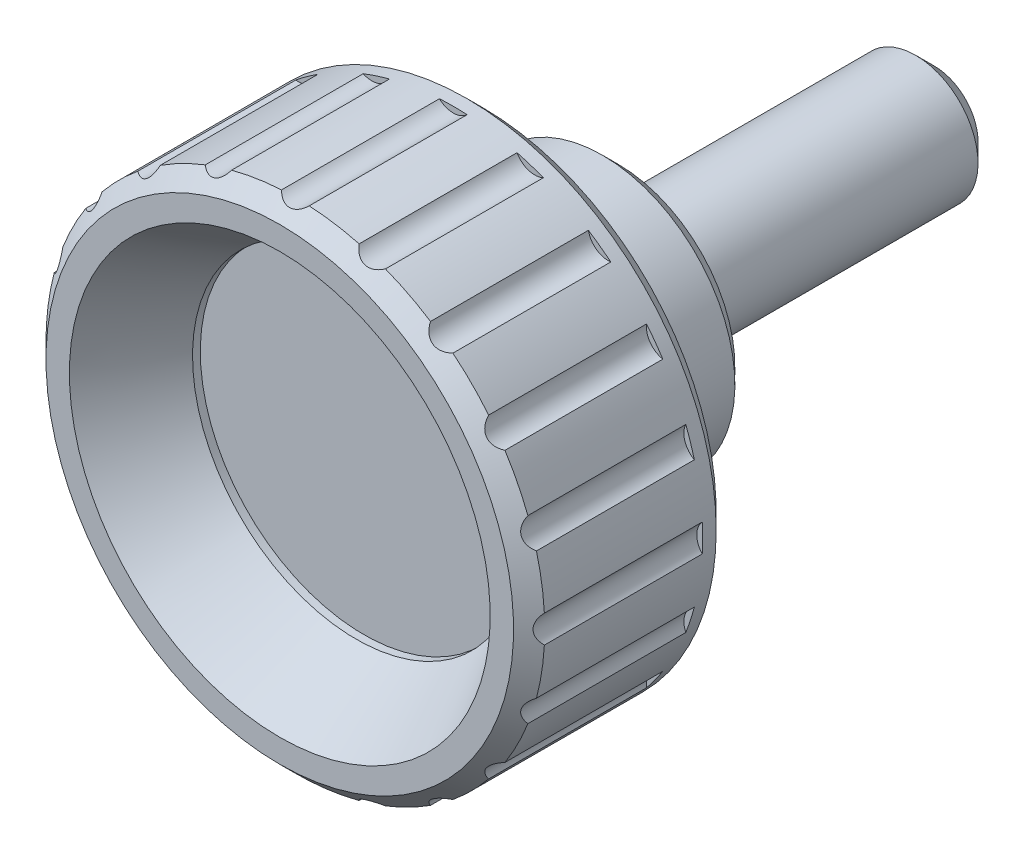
ISO-10303-21;
HEADER;
FILE_DESCRIPTION(('STEP AP214'),'2;1');
FILE_NAME('part.step','',(''),(''),'','','');
FILE_SCHEMA(('AUTOMOTIVE_DESIGN { 1 0 10303 214 1 1 1 1 }'));
ENDSEC;
DATA;
#1=APPLICATION_CONTEXT('core data for automotive mechanical design processes');
#2=APPLICATION_PROTOCOL_DEFINITION('international standard','automotive_design',2000,#1);
#3=PRODUCT_CONTEXT('',#1,'mechanical');
#4=PRODUCT('Part','Part','',(#3));
#5=PRODUCT_RELATED_PRODUCT_CATEGORY('part','',(#4));
#6=PRODUCT_DEFINITION_FORMATION('','',#4);
#7=PRODUCT_DEFINITION_CONTEXT('part definition',#1,'design');
#8=PRODUCT_DEFINITION('design','',#6,#7);
#9=PRODUCT_DEFINITION_SHAPE('','',#8);
#10=(LENGTH_UNIT() NAMED_UNIT(*) SI_UNIT(.MILLI.,.METRE.));
#11=(NAMED_UNIT(*) PLANE_ANGLE_UNIT() SI_UNIT($,.RADIAN.));
#12=(NAMED_UNIT(*) SI_UNIT($,.STERADIAN.) SOLID_ANGLE_UNIT());
#13=UNCERTAINTY_MEASURE_WITH_UNIT(LENGTH_MEASURE(1.E-05),#10,'distance_accuracy_value','');
#14=(GEOMETRIC_REPRESENTATION_CONTEXT(3) GLOBAL_UNCERTAINTY_ASSIGNED_CONTEXT((#13)) GLOBAL_UNIT_ASSIGNED_CONTEXT((#10,
#11,#12)) REPRESENTATION_CONTEXT('',''));
#15=CARTESIAN_POINT('',(0.,0.,0.));
#16=DIRECTION('',(0.,0.,1.));
#17=DIRECTION('',(1.,0.,0.));
#18=AXIS2_PLACEMENT_3D('',#15,#16,#17);
#19=CARTESIAN_POINT('',(0.,0.,0.));
#20=DIRECTION('',(0.,-3.55335756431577E-13,-1.));
#21=DIRECTION('',(0.,1.,-3.55335756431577E-13));
#22=AXIS2_PLACEMENT_3D('',#19,#20,#21);
#23=PLANE('',#22);
#24=CARTESIAN_POINT('',(0.,0.,0.));
#25=DIRECTION('',(0.,-3.55335756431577E-13,-1.));
#26=DIRECTION('',(0.,1.,-3.55335756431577E-13));
#27=AXIS2_PLACEMENT_3D('',#24,#25,#26);
#28=CIRCLE('',#27,5.);
#29=CARTESIAN_POINT('',(0.,5.,-1.77667878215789E-12));
#30=VERTEX_POINT('',#29);
#31=EDGE_CURVE('E1102',#30,#30,#28,.T.);
#32=ORIENTED_EDGE('',*,*,#31,.T.);
#33=EDGE_LOOP('',(#32));
#34=FACE_BOUND('',#33,.T.);
#35=CARTESIAN_POINT('',(0.,0.,0.));
#36=DIRECTION('',(0.,-3.55335756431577E-13,-1.));
#37=DIRECTION('',(0.,1.,-3.55335756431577E-13));
#38=AXIS2_PLACEMENT_3D('',#35,#36,#37);
#39=CIRCLE('',#38,4.);
#40=CARTESIAN_POINT('',(0.,4.,-1.42134302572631E-12));
#41=VERTEX_POINT('',#40);
#42=EDGE_CURVE('E1100',#41,#41,#39,.T.);
#43=ORIENTED_EDGE('',*,*,#42,.F.);
#44=EDGE_LOOP('',(#43));
#45=FACE_BOUND('',#44,.T.);
#46=ADVANCED_FACE('F14',(#34,#45),#23,.T.);
#47=CARTESIAN_POINT('',(-1.43127530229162E-12,7.46205088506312E-12,21.));
#48=DIRECTION('',(0.,-3.55335756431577E-13,-1.));
#49=DIRECTION('',(0.,1.,-3.55335756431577E-13));
#50=AXIS2_PLACEMENT_3D('',#47,#48,#49);
#51=CONICAL_SURFACE('',#50,16.,0.785398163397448);
#52=CARTESIAN_POINT('',(-1.49943126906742E-12,7.81738664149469E-12,22.));
#53=DIRECTION('',(0.,-3.55335756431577E-13,-1.));
#54=DIRECTION('',(0.,1.,-3.55335756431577E-13));
#55=AXIS2_PLACEMENT_3D('',#52,#53,#54);
#56=CIRCLE('',#55,15.);
#57=CARTESIAN_POINT('',(-1.49943126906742E-12,15.0000000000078,21.9999999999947));
#58=VERTEX_POINT('',#57);
#59=EDGE_CURVE('E582',#58,#58,#56,.T.);
#60=ORIENTED_EDGE('',*,*,#59,.T.);
#61=EDGE_LOOP('',(#60));
#62=FACE_BOUND('',#61,.T.);
#63=CARTESIAN_POINT('',(-1.43127530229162E-12,7.46205088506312E-12,21.));
#64=DIRECTION('',(0.,-3.55335756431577E-13,-1.));
#65=DIRECTION('',(0.,1.,-3.55335756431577E-13));
#66=AXIS2_PLACEMENT_3D('',#63,#64,#65);
#67=CIRCLE('',#66,16.);
#68=CARTESIAN_POINT('',(15.9753508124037,-0.887787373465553,21.0000000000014));
#69=VERTEX_POINT('',#68);
#70=CARTESIAN_POINT('',(15.4678028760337,-4.09231892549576,21.0000000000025));
#71=VERTEX_POINT('',#70);
#72=EDGE_CURVE('E587',#69,#71,#67,.T.);
#73=ORIENTED_EDGE('',*,*,#72,.F.);
#74=CARTESIAN_POINT('',(15.9755398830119,-0.887989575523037,20.9998000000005));
#75=CARTESIAN_POINT('',(15.9351784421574,-0.844826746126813,21.0424866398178));
#76=CARTESIAN_POINT('',(15.8966188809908,-0.797693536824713,21.0834537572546));
#77=CARTESIAN_POINT('',(15.8245769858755,-0.695019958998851,21.1602482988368));
#78=CARTESIAN_POINT('',(15.791150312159,-0.639398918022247,21.1960191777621));
#79=CARTESIAN_POINT('',(15.7380490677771,-0.532816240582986,21.2530008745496));
#80=CARTESIAN_POINT('',(15.7169614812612,-0.48337112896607,21.275690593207));
#81=CARTESIAN_POINT('',(15.6806455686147,-0.380207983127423,21.3148283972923));
#82=CARTESIAN_POINT('',(15.6653967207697,-0.326505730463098,21.3312983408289));
#83=CARTESIAN_POINT('',(15.6416857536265,-0.215315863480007,21.3569309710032));
#84=CARTESIAN_POINT('',(15.6332906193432,-0.157796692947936,21.366021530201));
#85=CARTESIAN_POINT('',(15.6243518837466,-0.0414082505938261,21.3757012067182));
#86=CARTESIAN_POINT('',(15.623808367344,0.0174610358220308,21.3762902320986));
#87=CARTESIAN_POINT('',(15.6301546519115,0.12624587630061,21.3694172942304));
#88=CARTESIAN_POINT('',(15.6360489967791,0.176295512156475,21.3630334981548));
#89=CARTESIAN_POINT('',(15.6532896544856,0.274274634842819,21.344383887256));
#90=CARTESIAN_POINT('',(15.6646343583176,0.322204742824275,21.33211980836));
#91=CARTESIAN_POINT('',(15.6925197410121,0.416525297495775,21.3020256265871));
#92=CARTESIAN_POINT('',(15.709218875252,0.462813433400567,21.2840259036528));
#93=CARTESIAN_POINT('',(15.7468524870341,0.551635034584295,21.2435491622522));
#94=CARTESIAN_POINT('',(15.7677958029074,0.594160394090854,21.2210628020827));
#95=CARTESIAN_POINT('',(15.8173070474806,0.682678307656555,21.168037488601));
#96=CARTESIAN_POINT('',(15.846568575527,0.727842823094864,21.1367787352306));
#97=CARTESIAN_POINT('',(15.9086393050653,0.812237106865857,21.0706895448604));
#98=CARTESIAN_POINT('',(15.9414255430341,0.851501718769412,21.0358822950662));
#99=CARTESIAN_POINT('',(15.9755398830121,0.887989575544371,20.9998));
#100=B_SPLINE_CURVE_WITH_KNOTS('',3,(#74,#75,#76,#77,#78,#79,#80,#81,#82,#83,#84,#85,#86,#87,
#88,#89,#90,#91,#92,#93,#94,#95,#96,#97,#98,#99),.UNSPECIFIED.,.F.,.F.,(4,2,2,2,2,2,2,2,2,2,2,2,
4),(0.,0.219100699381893,0.440431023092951,0.61478688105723,0.7885241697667,0.96393981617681,
1.13935735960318,1.29104866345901,1.44269521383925,1.59932369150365,1.75628175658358,
1.94245598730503,2.12748340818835),.UNSPECIFIED.);
#101=CARTESIAN_POINT('',(15.9753508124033,0.887787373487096,21.0000000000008));
#102=VERTEX_POINT('',#101);
#103=EDGE_CURVE('E588',#69,#102,#100,.T.);
#104=ORIENTED_EDGE('',*,*,#103,.T.);
#105=CARTESIAN_POINT('',(15.467802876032,4.09231892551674,20.9999999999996));
#106=VERTEX_POINT('',#105);
#107=EDGE_CURVE('E591',#106,#102,#67,.T.);
#108=ORIENTED_EDGE('',*,*,#107,.F.);
#109=CARTESIAN_POINT('',(15.4680028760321,4.09220841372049,20.9998349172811));
#110=CARTESIAN_POINT('',(15.4162815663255,4.12078731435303,21.0425185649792));
#111=CARTESIAN_POINT('',(15.3650471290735,4.15369881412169,21.0834826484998));
#112=CARTESIAN_POINT('',(15.2648091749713,4.22908574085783,21.1602711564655));
#113=CARTESIAN_POINT('',(15.2158336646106,4.27165508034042,21.1960390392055));
#114=CARTESIAN_POINT('',(15.1323998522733,4.35661227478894,21.2530163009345));
#115=CARTESIAN_POINT('',(15.0970664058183,4.39712151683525,21.2757043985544));
#116=CARTESIAN_POINT('',(15.030651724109,4.48401408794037,21.3148389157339));
#117=CARTESIAN_POINT('',(14.9995558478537,4.530376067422,21.3313071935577));
#118=CARTESIAN_POINT('',(14.9426490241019,4.62879687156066,21.3569365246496));
#119=CARTESIAN_POINT('',(14.9168920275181,4.68090639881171,21.3660254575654));
#120=CARTESIAN_POINT('',(14.8724279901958,4.78883525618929,21.3757021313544));
#121=CARTESIAN_POINT('',(14.8537210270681,4.84465462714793,21.3762897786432));
#122=CARTESIAN_POINT('',(14.8261428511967,4.95007522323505,21.3694146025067));
#123=CARTESIAN_POINT('',(14.8162835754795,4.9994964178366,21.363029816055));
#124=CARTESIAN_POINT('',(14.8024051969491,5.09800697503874,21.3443784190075));
#125=CARTESIAN_POINT('',(14.7983843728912,5.14709643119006,21.3321135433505));
#126=CARTESIAN_POINT('',(14.7957600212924,5.2454174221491,21.302017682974));
#127=CARTESIAN_POINT('',(14.7973389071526,5.29460058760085,21.2840169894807));
#128=CARTESIAN_POINT('',(14.8056849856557,5.39070462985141,21.243538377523));
#129=CARTESIAN_POINT('',(14.8124630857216,5.43762052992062,21.2210511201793));
#130=CARTESIAN_POINT('',(14.8321965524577,5.53709129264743,21.1680316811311));
#131=CARTESIAN_POINT('',(14.8460657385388,5.58907402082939,21.1367810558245));
#132=CARTESIAN_POINT('',(14.8790094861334,5.6884938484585,21.0707098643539));
#133=CARTESIAN_POINT('',(14.8980514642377,5.73595697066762,21.0359124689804));
#134=CARTESIAN_POINT('',(14.9192136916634,5.78119085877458,20.9998404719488));
#135=B_SPLINE_CURVE_WITH_KNOTS('',3,(#109,#110,#111,#112,#113,#114,#115,#116,#117,#118,#119,
#120,#121,#122,#123,#124,#125,#126,#127,#128,#129,#130,#131,#132,#133,#134),.UNSPECIFIED.,.F.,
.F.,(4,2,2,2,2,2,2,2,2,2,2,2,4),(0.,0.219090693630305,0.440410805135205,0.614763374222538,
0.788497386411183,0.963909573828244,1.13932369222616,1.29101393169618,1.44265944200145,
1.59928961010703,1.75624927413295,1.94237523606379,2.12735493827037),.UNSPECIFIED.);
#136=CARTESIAN_POINT('',(14.9191201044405,5.78099085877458,20.9999999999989));
#137=VERTEX_POINT('',#136);
#138=EDGE_CURVE('E276',#106,#137,#135,.T.);
#139=ORIENTED_EDGE('',*,*,#138,.T.);
#140=CARTESIAN_POINT('',(13.4461586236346,8.67184053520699,20.9999999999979));
#141=VERTEX_POINT('',#140);
#142=EDGE_CURVE('E594',#141,#137,#67,.T.);
#143=ORIENTED_EDGE('',*,*,#142,.F.);
#144=CARTESIAN_POINT('',(13.4463586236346,8.6718019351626,20.9998528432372));
#145=CARTESIAN_POINT('',(13.3883385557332,8.68300023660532,21.0425349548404));
#146=CARTESIAN_POINT('',(13.329442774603,8.69846942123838,21.0834974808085));
#147=CARTESIAN_POINT('',(13.2108177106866,8.73919269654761,21.1602828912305));
#148=CARTESIAN_POINT('',(13.151086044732,8.76454475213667,21.1960492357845));
#149=CARTESIAN_POINT('',(13.045484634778,8.81956217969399,21.2530242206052));
#150=CARTESIAN_POINT('',(12.9993630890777,8.84717062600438,21.275711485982));
#151=CARTESIAN_POINT('',(12.9093490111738,8.90928797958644,21.3148443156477));
#152=CARTESIAN_POINT('',(12.865449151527,8.94377205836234,21.3313117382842));
#153=CARTESIAN_POINT('',(12.7809154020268,9.0197911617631,21.3569393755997));
#154=CARTESIAN_POINT('',(12.7403171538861,9.06139107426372,21.3660274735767));
#155=CARTESIAN_POINT('',(12.6646792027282,9.15029744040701,21.3757026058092));
#156=CARTESIAN_POINT('',(12.6296395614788,9.19760395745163,21.3762895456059));
#157=CARTESIAN_POINT('',(12.5708357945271,9.28934266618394,21.3694132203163));
#158=CARTESIAN_POINT('',(12.5461876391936,9.33329835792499,21.3630279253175));
#159=CARTESIAN_POINT('',(12.5025481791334,9.42269874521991,21.3443756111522));
#160=CARTESIAN_POINT('',(12.4835552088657,9.46814299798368,21.3321103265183));
#161=CARTESIAN_POINT('',(12.4506773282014,9.56084100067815,21.3020136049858));
#162=CARTESIAN_POINT('',(12.4369809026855,9.6081051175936,21.2840124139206));
#163=CARTESIAN_POINT('',(12.4152215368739,9.70208497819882,21.2435328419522));
#164=CARTESIAN_POINT('',(12.4071705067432,9.7487993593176,21.2210451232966));
#165=CARTESIAN_POINT('',(12.3952016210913,9.84949409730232,21.168027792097));
#166=CARTESIAN_POINT('',(12.3923288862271,9.9032128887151,21.1367802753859));
#167=CARTESIAN_POINT('',(12.3929374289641,10.0079364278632,21.0707160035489));
#168=CARTESIAN_POINT('',(12.3963796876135,10.0589558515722,21.0359224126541));
#169=CARTESIAN_POINT('',(12.4025267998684,10.1085106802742,20.9998544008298));
#170=B_SPLINE_CURVE_WITH_KNOTS('',3,(#144,#145,#146,#147,#148,#149,#150,#151,#152,#153,#154,
#155,#156,#157,#158,#159,#160,#161,#162,#163,#164,#165,#166,#167,#168,#169),.UNSPECIFIED.,.F.,
.F.,(4,2,2,2,2,2,2,2,2,2,2,2,4),(0.,0.21908555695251,0.440400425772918,0.61475130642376,
0.788483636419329,0.963894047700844,1.1393064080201,1.29099610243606,1.4426410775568,
1.59927210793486,1.75623259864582,1.94233964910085,2.12730065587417),.UNSPECIFIED.);
#171=CARTESIAN_POINT('',(12.4025019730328,10.1083106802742,20.9999999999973));
#172=VERTEX_POINT('',#171);
#173=EDGE_CURVE('E517',#141,#172,#170,.T.);
#174=ORIENTED_EDGE('',*,*,#173,.T.);
#175=CARTESIAN_POINT('',(10.1083106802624,12.4025019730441,20.9999999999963));
#176=VERTEX_POINT('',#175);
#177=EDGE_CURVE('E1303',#176,#172,#67,.T.);
#178=ORIENTED_EDGE('',*,*,#177,.F.);
#179=CARTESIAN_POINT('',(10.1085106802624,12.4025267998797,20.9998544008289));
#180=CARTESIAN_POINT('',(10.0498699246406,12.3952479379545,21.042536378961));
#181=CARTESIAN_POINT('',(9.9890765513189,12.3917603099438,21.0834987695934));
#182=CARTESIAN_POINT('',(9.86367341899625,12.3938334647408,21.1602839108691));
#183=CARTESIAN_POINT('',(9.79903112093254,12.3994866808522,21.1960501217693));
#184=CARTESIAN_POINT('',(9.68159704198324,12.4191788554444,21.2530249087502));
#185=CARTESIAN_POINT('',(9.62920140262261,12.4311837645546,21.2757121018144));
#186=CARTESIAN_POINT('',(9.52439769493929,12.4624451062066,21.3148447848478));
#187=CARTESIAN_POINT('',(9.47199033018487,12.4816756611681,21.3313121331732));
#188=CARTESIAN_POINT('',(9.36810287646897,12.527851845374,21.3569396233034));
#189=CARTESIAN_POINT('',(9.31663663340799,12.5548702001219,21.3660276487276));
#190=CARTESIAN_POINT('',(9.21722722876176,12.6160518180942,21.3757026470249));
#191=CARTESIAN_POINT('',(9.16928410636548,12.6502151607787,21.3762895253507));
#192=CARTESIAN_POINT('',(9.08500969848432,12.7192925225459,21.3694131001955));
#193=CARTESIAN_POINT('',(9.04798489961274,12.7534801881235,21.3630277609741));
#194=CARTESIAN_POINT('',(8.97885516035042,12.825019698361,21.3443753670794));
#195=CARTESIAN_POINT('',(8.94674877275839,12.8623706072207,21.3321100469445));
#196=CARTESIAN_POINT('',(8.8868348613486,12.9403718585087,21.3020132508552));
#197=CARTESIAN_POINT('',(8.85920339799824,12.9810903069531,21.2840120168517));
#198=CARTESIAN_POINT('',(8.80946769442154,13.0637465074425,21.243532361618));
#199=CARTESIAN_POINT('',(8.78737520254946,13.1056866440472,21.2210446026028));
#200=CARTESIAN_POINT('',(8.74487571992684,13.1977546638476,21.1680270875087));
#201=CARTESIAN_POINT('',(8.72554355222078,13.247956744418,21.1367794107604));
#202=CARTESIAN_POINT('',(8.69376097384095,13.3477431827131,21.0707148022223));
#203=CARTESIAN_POINT('',(8.68126891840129,13.3973294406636,21.0359210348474));
#204=CARTESIAN_POINT('',(8.67180193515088,13.4463586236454,20.9998528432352));
#205=B_SPLINE_CURVE_WITH_KNOTS('',3,(#179,#180,#181,#182,#183,#184,#185,#186,#187,#188,#189,
#190,#191,#192,#193,#194,#195,#196,#197,#198,#199,#200,#201,#202,#203,#204),.UNSPECIFIED.,.F.,
.F.,(4,2,2,2,2,2,2,2,2,2,2,2,4),(0.,0.219085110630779,0.440399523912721,0.614750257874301,
0.788482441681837,0.963892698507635,1.13930490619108,1.29099455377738,1.44263948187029,
1.599270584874,1.75623114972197,1.94233892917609,2.12730065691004),.UNSPECIFIED.);
#206=CARTESIAN_POINT('',(8.67184053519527,13.4461586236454,20.9999999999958));
#207=VERTEX_POINT('',#206);
#208=EDGE_CURVE('E1293',#176,#207,#205,.T.);
#209=ORIENTED_EDGE('',*,*,#208,.T.);
#210=CARTESIAN_POINT('',(5.78099085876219,14.9191201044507,20.9999999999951));
#211=VERTEX_POINT('',#210);
#212=EDGE_CURVE('E601',#211,#207,#67,.T.);
#213=ORIENTED_EDGE('',*,*,#212,.F.);
#214=CARTESIAN_POINT('',(5.78119085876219,14.9192136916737,20.9998404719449));
#215=CARTESIAN_POINT('',(5.72766915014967,14.8941689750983,21.0425236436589));
#216=CARTESIAN_POINT('',(5.67092851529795,14.872064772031,21.0834872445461));
#217=CARTESIAN_POINT('',(5.5510212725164,14.8352827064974,21.1602747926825));
#218=CARTESIAN_POINT('',(5.48779515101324,14.8206827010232,21.1960421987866));
#219=CARTESIAN_POINT('',(5.37002254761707,14.8031204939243,21.2530187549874));
#220=CARTESIAN_POINT('',(5.31648146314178,14.7983461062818,21.2757065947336));
#221=CARTESIAN_POINT('',(5.20714649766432,14.7956901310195,21.3148405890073));
#222=CARTESIAN_POINT('',(5.15136128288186,14.7977841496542,21.3313086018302));
#223=CARTESIAN_POINT('',(5.03828848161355,14.8095962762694,21.3569374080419));
#224=CARTESIAN_POINT('',(4.98099158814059,14.8193878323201,21.3660260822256));
#225=CARTESIAN_POINT('',(4.86754042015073,14.8468549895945,21.3757022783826));
#226=CARTESIAN_POINT('',(4.81138615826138,14.8645306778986,21.3762897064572));
#227=CARTESIAN_POINT('',(4.7098894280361,14.9041843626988,21.3694141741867));
#228=CARTESIAN_POINT('',(4.66411184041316,14.9252571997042,21.3630292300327));
#229=CARTESIAN_POINT('',(4.5762579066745,14.971932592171,21.344377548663));
#230=CARTESIAN_POINT('',(4.53418047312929,14.9975338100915,21.3321125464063));
#231=CARTESIAN_POINT('',(4.45309476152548,15.0532024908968,21.3020164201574));
#232=CARTESIAN_POINT('',(4.41423284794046,15.0833891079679,21.2840155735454));
#233=CARTESIAN_POINT('',(4.3413888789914,15.1466300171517,21.2435366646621));
#234=CARTESIAN_POINT('',(4.30741726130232,15.1796902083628,21.2210492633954));
#235=CARTESIAN_POINT('',(4.2385424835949,15.2541231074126,21.1680291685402));
#236=CARTESIAN_POINT('',(4.20463940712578,15.2958988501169,21.136777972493));
#237=CARTESIAN_POINT('',(4.1435705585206,15.3809897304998,21.0707055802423));
#238=CARTESIAN_POINT('',(4.11636458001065,15.4242938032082,21.0359075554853));
#239=CARTESIAN_POINT('',(4.09220841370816,15.4680028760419,20.9998349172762));
#240=B_SPLINE_CURVE_WITH_KNOTS('',3,(#214,#215,#216,#217,#218,#219,#220,#221,#222,#223,#224,
#225,#226,#227,#228,#229,#230,#231,#232,#233,#234,#235,#236,#237,#238,#239),.UNSPECIFIED.,.F.,
.F.,(4,2,2,2,2,2,2,2,2,2,2,2,4),(0.,0.21908910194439,0.440407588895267,0.614759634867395,
0.78849312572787,0.963904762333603,1.13931833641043,1.29100840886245,1.44265375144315,
1.59928417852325,1.7562441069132,1.9423726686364,2.12735494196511),.UNSPECIFIED.);
#241=CARTESIAN_POINT('',(4.09231892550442,15.4678028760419,20.9999999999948));
#242=VERTEX_POINT('',#241);
#243=EDGE_CURVE('E1285',#211,#242,#240,.T.);
#244=ORIENTED_EDGE('',*,*,#243,.T.);
#245=CARTESIAN_POINT('',(0.887787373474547,15.9753508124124,20.9999999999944));
#246=VERTEX_POINT('',#245);
#247=EDGE_CURVE('E597',#246,#242,#67,.T.);
#248=ORIENTED_EDGE('',*,*,#247,.F.);
#249=CARTESIAN_POINT('',(0.887987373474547,15.9755378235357,20.9998021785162));
#250=CARTESIAN_POINT('',(0.844824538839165,15.9351765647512,21.0424886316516));
#251=CARTESIAN_POINT('',(0.797691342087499,15.8966171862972,21.0834555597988));
#252=CARTESIAN_POINT('',(0.695017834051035,15.8245756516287,21.1602497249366));
#253=CARTESIAN_POINT('',(0.639396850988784,15.7911491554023,21.1960204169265));
#254=CARTESIAN_POINT('',(0.532814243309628,15.7380481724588,21.2530018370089));
#255=CARTESIAN_POINT('',(0.483369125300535,15.716960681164,21.2756914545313));
#256=CARTESIAN_POINT('',(0.380205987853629,15.6806449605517,21.3148290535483));
#257=CARTESIAN_POINT('',(0.326503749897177,15.665396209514,21.3312988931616));
#258=CARTESIAN_POINT('',(0.215313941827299,15.6416854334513,21.3569313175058));
#259=CARTESIAN_POINT('',(0.157794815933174,15.6332903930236,21.3660217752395));
#260=CARTESIAN_POINT('',(0.0414064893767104,15.6243518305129,21.3757012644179));
#261=CARTESIAN_POINT('',(-0.0174627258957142,15.6238083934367,21.3762902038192));
#262=CARTESIAN_POINT('',(-0.1262474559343,15.6301548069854,21.3694171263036));
#263=CARTESIAN_POINT('',(-0.176297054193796,15.6360492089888,21.3630332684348));
#264=CARTESIAN_POINT('',(-0.274276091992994,15.6532899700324,21.3443835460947));
#265=CARTESIAN_POINT('',(-0.322206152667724,15.664634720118,21.332119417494));
#266=CARTESIAN_POINT('',(-0.416526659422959,15.6925202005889,21.3020251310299));
#267=CARTESIAN_POINT('',(-0.462814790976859,15.7092193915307,21.2840253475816));
#268=CARTESIAN_POINT('',(-0.551636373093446,15.7468531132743,21.2435484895));
#269=CARTESIAN_POINT('',(-0.594161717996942,15.7677964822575,21.2210620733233));
#270=CARTESIAN_POINT('',(-0.682678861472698,15.8173074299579,21.1680370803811));
#271=CARTESIAN_POINT('',(-0.72784270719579,15.8465685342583,21.1367787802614));
#272=CARTESIAN_POINT('',(-0.812235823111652,15.9086383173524,21.0706905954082));
#273=CARTESIAN_POINT('',(-0.851499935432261,15.9414240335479,21.0358838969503));
#274=CARTESIAN_POINT('',(-0.887987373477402,15.9755378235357,20.999802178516));
#275=B_SPLINE_CURVE_WITH_KNOTS('',3,(#249,#250,#251,#252,#253,#254,#255,#256,#257,#258,#259,
#260,#261,#262,#263,#264,#265,#266,#267,#268,#269,#270,#271,#272,#273,#274),.UNSPECIFIED.,.F.,
.F.,(4,2,2,2,2,2,2,2,2,2,2,2,4),(0.,0.219100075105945,0.440429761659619,0.614785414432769,
0.788522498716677,0.963937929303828,1.13935525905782,1.29104649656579,1.44269298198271,
1.59932156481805,1.75627972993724,1.94245124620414,2.12747598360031),.UNSPECIFIED.);
#276=CARTESIAN_POINT('',(-0.887787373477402,15.9753508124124,20.9999999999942));
#277=VERTEX_POINT('',#276);
#278=EDGE_CURVE('E1278',#246,#277,#275,.T.);
#279=ORIENTED_EDGE('',*,*,#278,.T.);
#280=CARTESIAN_POINT('',(-4.09231892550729,15.4678028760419,20.9999999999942));
#281=VERTEX_POINT('',#280);
#282=EDGE_CURVE('E602',#281,#277,#67,.T.);
#283=ORIENTED_EDGE('',*,*,#282,.F.);
#284=CARTESIAN_POINT('',(-4.09220841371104,15.4680028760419,20.9998349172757));
#285=CARTESIAN_POINT('',(-4.12078731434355,15.4162815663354,21.0425185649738));
#286=CARTESIAN_POINT('',(-4.15369881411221,15.3650471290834,21.0834826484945));
#287=CARTESIAN_POINT('',(-4.22908574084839,15.2648091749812,21.1602711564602));
#288=CARTESIAN_POINT('',(-4.271655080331,15.2158336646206,21.1960390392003));
#289=CARTESIAN_POINT('',(-4.35661227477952,15.1323998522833,21.2530163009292));
#290=CARTESIAN_POINT('',(-4.39712151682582,15.0970664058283,21.2757043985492));
#291=CARTESIAN_POINT('',(-4.48401408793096,15.0306517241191,21.3148389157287));
#292=CARTESIAN_POINT('',(-4.53037606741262,14.9995558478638,21.3313071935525));
#293=CARTESIAN_POINT('',(-4.6287968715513,14.942649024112,21.3569365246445));
#294=CARTESIAN_POINT('',(-4.68090639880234,14.9168920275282,21.3660254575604));
#295=CARTESIAN_POINT('',(-4.78883525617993,14.872427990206,21.3757021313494));
#296=CARTESIAN_POINT('',(-4.84465462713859,14.8537210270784,21.3762897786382));
#297=CARTESIAN_POINT('',(-4.95007522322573,14.826142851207,21.3694146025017));
#298=CARTESIAN_POINT('',(-4.99949641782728,14.8162835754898,21.3630298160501));
#299=CARTESIAN_POINT('',(-5.09800697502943,14.8024051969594,21.3443784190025));
#300=CARTESIAN_POINT('',(-5.14709643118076,14.7983843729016,21.3321135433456));
#301=CARTESIAN_POINT('',(-5.24541742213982,14.7957600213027,21.3020176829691));
#302=CARTESIAN_POINT('',(-5.29460058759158,14.797338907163,21.2840169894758));
#303=CARTESIAN_POINT('',(-5.39070462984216,14.805684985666,21.2435383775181));
#304=CARTESIAN_POINT('',(-5.43762052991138,14.8124630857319,21.2210511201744));
#305=CARTESIAN_POINT('',(-5.53709129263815,14.832196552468,21.1680316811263));
#306=CARTESIAN_POINT('',(-5.58907402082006,14.8460657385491,21.1367810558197));
#307=CARTESIAN_POINT('',(-5.68849384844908,14.8790094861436,21.0707098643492));
#308=CARTESIAN_POINT('',(-5.73595697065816,14.8980514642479,21.0359124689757));
#309=CARTESIAN_POINT('',(-5.78119085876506,14.9192136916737,20.9998404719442));
#310=B_SPLINE_CURVE_WITH_KNOTS('',3,(#284,#285,#286,#287,#288,#289,#290,#291,#292,#293,#294,
#295,#296,#297,#298,#299,#300,#301,#302,#303,#304,#305,#306,#307,#308,#309),.UNSPECIFIED.,.F.,
.F.,(4,2,2,2,2,2,2,2,2,2,2,2,4),(0.,0.219090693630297,0.440410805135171,0.614763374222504,
0.788497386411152,0.96390957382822,1.13932369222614,1.29101393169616,1.44265944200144,
1.59928961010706,1.75624927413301,1.94237523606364,2.12735493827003),.UNSPECIFIED.);
#311=CARTESIAN_POINT('',(-5.78099085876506,14.9191201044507,20.9999999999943));
#312=VERTEX_POINT('',#311);
#313=EDGE_CURVE('E1271',#281,#312,#310,.T.);
#314=ORIENTED_EDGE('',*,*,#313,.T.);
#315=CARTESIAN_POINT('',(-8.67184053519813,13.4461586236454,20.9999999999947));
#316=VERTEX_POINT('',#315);
#317=EDGE_CURVE('E1140',#316,#312,#67,.T.);
#318=ORIENTED_EDGE('',*,*,#317,.F.);
#319=CARTESIAN_POINT('',(-8.67180193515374,13.4463586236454,20.999852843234));
#320=CARTESIAN_POINT('',(-8.68300023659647,13.3883385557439,21.0425349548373));
#321=CARTESIAN_POINT('',(-8.69846942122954,13.3294427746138,21.0834974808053));
#322=CARTESIAN_POINT('',(-8.73919269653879,13.2108177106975,21.1602828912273));
#323=CARTESIAN_POINT('',(-8.76454475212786,13.1510860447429,21.1960492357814));
#324=CARTESIAN_POINT('',(-8.81956217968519,13.0454846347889,21.253024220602));
#325=CARTESIAN_POINT('',(-8.84717062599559,12.9993630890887,21.2757114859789));
#326=CARTESIAN_POINT('',(-8.90928797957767,12.9093490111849,21.3148443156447));
#327=CARTESIAN_POINT('',(-8.94377205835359,12.8654491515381,21.3313117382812));
#328=CARTESIAN_POINT('',(-9.01979116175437,12.780915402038,21.3569393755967));
#329=CARTESIAN_POINT('',(-9.06139107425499,12.7403171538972,21.3660274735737));
#330=CARTESIAN_POINT('',(-9.1502974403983,12.6646792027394,21.3757026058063));
#331=CARTESIAN_POINT('',(-9.19760395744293,12.62963956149,21.376289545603));
#332=CARTESIAN_POINT('',(-9.28934266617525,12.5708357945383,21.3694132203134));
#333=CARTESIAN_POINT('',(-9.3332983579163,12.5461876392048,21.3630279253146));
#334=CARTESIAN_POINT('',(-9.42269874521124,12.5025481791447,21.3443756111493));
#335=CARTESIAN_POINT('',(-9.46814299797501,12.483555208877,21.3321103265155));
#336=CARTESIAN_POINT('',(-9.56084100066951,12.4506773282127,21.302013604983));
#337=CARTESIAN_POINT('',(-9.60810511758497,12.4369809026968,21.2840124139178));
#338=CARTESIAN_POINT('',(-9.70208497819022,12.4152215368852,21.2435328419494));
#339=CARTESIAN_POINT('',(-9.74879935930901,12.4071705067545,21.2210451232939));
#340=CARTESIAN_POINT('',(-9.84949409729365,12.3952016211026,21.1680277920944));
#341=CARTESIAN_POINT('',(-9.90321288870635,12.3923288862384,21.1367802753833));
#342=CARTESIAN_POINT('',(-10.0079364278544,12.3929374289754,21.0707160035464));
#343=CARTESIAN_POINT('',(-10.0589558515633,12.3963796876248,21.0359224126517));
#344=CARTESIAN_POINT('',(-10.1085106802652,12.4025267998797,20.9998544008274));
#345=B_SPLINE_CURVE_WITH_KNOTS('',3,(#319,#320,#321,#322,#323,#324,#325,#326,#327,#328,#329,
#330,#331,#332,#333,#334,#335,#336,#337,#338,#339,#340,#341,#342,#343,#344),.UNSPECIFIED.,.F.,
.F.,(4,2,2,2,2,2,2,2,2,2,2,2,4),(0.,0.21908555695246,0.440400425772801,0.614751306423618,
0.78848363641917,0.96389404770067,1.13930640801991,1.29099610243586,1.4426410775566,
1.59927210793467,1.75623259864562,1.94233964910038,2.12730065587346),.UNSPECIFIED.);
#346=CARTESIAN_POINT('',(-10.1083106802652,12.4025019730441,20.9999999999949));
#347=VERTEX_POINT('',#346);
#348=EDGE_CURVE('E1264',#316,#347,#345,.T.);
#349=ORIENTED_EDGE('',*,*,#348,.T.);
#350=CARTESIAN_POINT('',(-12.402501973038,10.1083106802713,20.9999999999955));
#351=VERTEX_POINT('',#350);
#352=EDGE_CURVE('E1143',#351,#347,#67,.T.);
#353=ORIENTED_EDGE('',*,*,#352,.F.);
#354=CARTESIAN_POINT('',(-12.4025267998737,10.1085106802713,20.9998544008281));
#355=CARTESIAN_POINT('',(-12.3952479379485,10.0498699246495,21.0425363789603));
#356=CARTESIAN_POINT('',(-12.3917603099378,9.98907655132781,21.0834987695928));
#357=CARTESIAN_POINT('',(-12.3938334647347,9.86367341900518,21.1602839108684));
#358=CARTESIAN_POINT('',(-12.3994866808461,9.79903112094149,21.1960501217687));
#359=CARTESIAN_POINT('',(-12.4191788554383,9.6815970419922,21.2530249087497));
#360=CARTESIAN_POINT('',(-12.4311837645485,9.62920140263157,21.2757121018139));
#361=CARTESIAN_POINT('',(-12.4624451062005,9.52439769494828,21.3148447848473));
#362=CARTESIAN_POINT('',(-12.481675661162,9.47199033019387,21.3313121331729));
#363=CARTESIAN_POINT('',(-12.5278518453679,9.36810287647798,21.356939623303));
#364=CARTESIAN_POINT('',(-12.5548702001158,9.316636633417,21.3660276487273));
#365=CARTESIAN_POINT('',(-12.6160518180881,9.21722722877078,21.3757026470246));
#366=CARTESIAN_POINT('',(-12.6502151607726,9.1692841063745,21.3762895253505));
#367=CARTESIAN_POINT('',(-12.7192925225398,9.08500969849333,21.3694131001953));
#368=CARTESIAN_POINT('',(-12.7534801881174,9.04798489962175,21.363027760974));
#369=CARTESIAN_POINT('',(-12.8250196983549,8.97885516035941,21.3443753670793));
#370=CARTESIAN_POINT('',(-12.8623706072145,8.94674877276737,21.3321100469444));
#371=CARTESIAN_POINT('',(-12.9403718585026,8.88683486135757,21.3020132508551));
#372=CARTESIAN_POINT('',(-12.9810903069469,8.8592033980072,21.2840120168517));
#373=CARTESIAN_POINT('',(-13.0637465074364,8.8094676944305,21.243532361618));
#374=CARTESIAN_POINT('',(-13.1056866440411,8.78737520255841,21.2210446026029));
#375=CARTESIAN_POINT('',(-13.1977546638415,8.74487571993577,21.1680270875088));
#376=CARTESIAN_POINT('',(-13.247956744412,8.72554355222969,21.1367794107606));
#377=CARTESIAN_POINT('',(-13.347743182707,8.69376097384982,21.0707148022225));
#378=CARTESIAN_POINT('',(-13.3973294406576,8.68126891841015,21.0359210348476));
#379=CARTESIAN_POINT('',(-13.4463586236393,8.67180193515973,20.9998528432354));
#380=B_SPLINE_CURVE_WITH_KNOTS('',3,(#354,#355,#356,#357,#358,#359,#360,#361,#362,#363,#364,
#365,#366,#367,#368,#369,#370,#371,#372,#373,#374,#375,#376,#377,#378,#379),.UNSPECIFIED.,.F.,
.F.,(4,2,2,2,2,2,2,2,2,2,2,2,4),(0.,0.219085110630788,0.440399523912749,0.614750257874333,
0.788482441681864,0.963892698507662,1.13930490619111,1.29099455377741,1.44263948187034,
1.59927058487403,1.75623114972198,1.94233892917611,2.12730065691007),.UNSPECIFIED.);
#381=CARTESIAN_POINT('',(-13.4461586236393,8.67184053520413,20.999999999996));
#382=VERTEX_POINT('',#381);
#383=EDGE_CURVE('E1254',#351,#382,#380,.T.);
#384=ORIENTED_EDGE('',*,*,#383,.T.);
#385=CARTESIAN_POINT('',(-14.9191201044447,5.78099085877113,20.999999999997));
#386=VERTEX_POINT('',#385);
#387=EDGE_CURVE('E1146',#386,#382,#67,.T.);
#388=ORIENTED_EDGE('',*,*,#387,.F.);
#389=CARTESIAN_POINT('',(-14.9192136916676,5.78119085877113,20.9998404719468));
#390=CARTESIAN_POINT('',(-14.8941689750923,5.7276691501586,21.0425236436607));
#391=CARTESIAN_POINT('',(-14.8720647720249,5.6709285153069,21.0834872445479));
#392=CARTESIAN_POINT('',(-14.8352827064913,5.5510212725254,21.1602747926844));
#393=CARTESIAN_POINT('',(-14.8206827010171,5.48779515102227,21.1960421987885));
#394=CARTESIAN_POINT('',(-14.8031204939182,5.37002254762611,21.2530187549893));
#395=CARTESIAN_POINT('',(-14.7983461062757,5.31648146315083,21.2757065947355));
#396=CARTESIAN_POINT('',(-14.7956901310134,5.20714649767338,21.3148405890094));
#397=CARTESIAN_POINT('',(-14.797784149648,5.15136128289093,21.3313086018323));
#398=CARTESIAN_POINT('',(-14.8095962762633,5.03828848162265,21.356937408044));
#399=CARTESIAN_POINT('',(-14.819387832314,4.9809915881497,21.3660260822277));
#400=CARTESIAN_POINT('',(-14.8468549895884,4.86754042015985,21.3757022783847));
#401=CARTESIAN_POINT('',(-14.8645306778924,4.81138615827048,21.3762897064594));
#402=CARTESIAN_POINT('',(-14.9041843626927,4.70988942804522,21.369414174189));
#403=CARTESIAN_POINT('',(-14.9252571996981,4.66411184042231,21.363029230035));
#404=CARTESIAN_POINT('',(-14.9719325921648,4.57625790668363,21.3443775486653));
#405=CARTESIAN_POINT('',(-14.9975338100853,4.53418047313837,21.3321125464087));
#406=CARTESIAN_POINT('',(-15.0532024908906,4.45309476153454,21.3020164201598));
#407=CARTESIAN_POINT('',(-15.0833891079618,4.41423284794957,21.2840155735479));
#408=CARTESIAN_POINT('',(-15.1466300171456,4.3413888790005,21.2435366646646));
#409=CARTESIAN_POINT('',(-15.1796902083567,4.30741726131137,21.2210492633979));
#410=CARTESIAN_POINT('',(-15.2541231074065,4.2385424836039,21.1680291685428));
#411=CARTESIAN_POINT('',(-15.2958988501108,4.20463940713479,21.1367779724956));
#412=CARTESIAN_POINT('',(-15.3809897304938,4.14357055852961,21.0707055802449));
#413=CARTESIAN_POINT('',(-15.4242938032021,4.11636458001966,21.0359075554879));
#414=CARTESIAN_POINT('',(-15.4680028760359,4.0922084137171,20.9998349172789));
#415=B_SPLINE_CURVE_WITH_KNOTS('',3,(#389,#390,#391,#392,#393,#394,#395,#396,#397,#398,#399,
#400,#401,#402,#403,#404,#405,#406,#407,#408,#409,#410,#411,#412,#413,#414),.UNSPECIFIED.,.F.,
.F.,(4,2,2,2,2,2,2,2,2,2,2,2,4),(0.,0.219089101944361,0.440407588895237,0.614759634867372,
0.788493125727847,0.963904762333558,1.13931833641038,1.29100840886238,1.44265375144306,
1.59928417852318,1.75624410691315,1.94237266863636,2.12735494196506),.UNSPECIFIED.);
#416=CARTESIAN_POINT('',(-15.4678028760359,4.09231892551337,20.9999999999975));
#417=VERTEX_POINT('',#416);
#418=EDGE_CURVE('E1247',#386,#417,#415,.T.);
#419=ORIENTED_EDGE('',*,*,#418,.T.);
#420=CARTESIAN_POINT('',(-15.9753508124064,0.887787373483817,20.9999999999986));
#421=VERTEX_POINT('',#420);
#422=EDGE_CURVE('E1149',#421,#417,#67,.T.);
#423=ORIENTED_EDGE('',*,*,#422,.F.);
#424=CARTESIAN_POINT('',(-15.9755398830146,0.887989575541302,20.9997999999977));
#425=CARTESIAN_POINT('',(-15.9351784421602,0.84482674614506,21.042486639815));
#426=CARTESIAN_POINT('',(-15.8966188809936,0.797693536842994,21.0834537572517));
#427=CARTESIAN_POINT('',(-15.8245769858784,0.695019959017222,21.160248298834));
#428=CARTESIAN_POINT('',(-15.791150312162,0.639398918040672,21.1960191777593));
#429=CARTESIAN_POINT('',(-15.7380490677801,0.53281624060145,21.2530008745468));
#430=CARTESIAN_POINT('',(-15.7169614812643,0.483371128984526,21.2756905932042));
#431=CARTESIAN_POINT('',(-15.6806455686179,0.380207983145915,21.3148283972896));
#432=CARTESIAN_POINT('',(-15.6653967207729,0.326505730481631,21.3312983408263));
#433=CARTESIAN_POINT('',(-15.6416857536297,0.215315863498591,21.3569309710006));
#434=CARTESIAN_POINT('',(-15.6332906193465,0.157796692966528,21.3660215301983));
#435=CARTESIAN_POINT('',(-15.62435188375,0.0414082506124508,21.3757012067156));
#436=CARTESIAN_POINT('',(-15.6238083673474,-0.0174610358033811,21.376290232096));
#437=CARTESIAN_POINT('',(-15.6301546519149,-0.126245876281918,21.3694172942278));
#438=CARTESIAN_POINT('',(-15.6360489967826,-0.176295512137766,21.3630334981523));
#439=CARTESIAN_POINT('',(-15.6532896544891,-0.274274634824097,21.3443838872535));
#440=CARTESIAN_POINT('',(-15.6646343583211,-0.322204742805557,21.3321198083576));
#441=CARTESIAN_POINT('',(-15.6925197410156,-0.416525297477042,21.3020256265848));
#442=CARTESIAN_POINT('',(-15.7092188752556,-0.462813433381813,21.2840259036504));
#443=CARTESIAN_POINT('',(-15.7468524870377,-0.551635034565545,21.2435491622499));
#444=CARTESIAN_POINT('',(-15.767795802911,-0.594160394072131,21.2210628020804));
#445=CARTESIAN_POINT('',(-15.8173070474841,-0.682678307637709,21.1680374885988));
#446=CARTESIAN_POINT('',(-15.8465685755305,-0.727842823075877,21.1367787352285));
#447=CARTESIAN_POINT('',(-15.9086393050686,-0.812237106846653,21.0706895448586));
#448=CARTESIAN_POINT('',(-15.9414255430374,-0.851501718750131,21.0358822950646));
#449=CARTESIAN_POINT('',(-15.9755398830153,-0.887989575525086,20.9997999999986));
#450=B_SPLINE_CURVE_WITH_KNOTS('',3,(#424,#425,#426,#427,#428,#429,#430,#431,#432,#433,#434,
#435,#436,#437,#438,#439,#440,#441,#442,#443,#444,#445,#446,#447,#448,#449),.UNSPECIFIED.,.F.,
.F.,(4,2,2,2,2,2,2,2,2,2,2,2,4),(0.,0.219100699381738,0.440431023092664,0.614786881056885,
0.788524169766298,0.963939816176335,1.13935735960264,1.29104866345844,1.44269521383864,
1.59932369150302,1.75628175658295,1.94245598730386,2.12748340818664),.UNSPECIFIED.);
#451=CARTESIAN_POINT('',(-15.9753508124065,-0.887787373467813,20.9999999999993));
#452=VERTEX_POINT('',#451);
#453=EDGE_CURVE('E1240',#421,#452,#450,.T.);
#454=ORIENTED_EDGE('',*,*,#453,.T.);
#455=CARTESIAN_POINT('',(-15.467802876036,-4.09231892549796,21.0000000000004));
#456=VERTEX_POINT('',#455);
#457=EDGE_CURVE('E1152',#456,#452,#67,.T.);
#458=ORIENTED_EDGE('',*,*,#457,.F.);
#459=CARTESIAN_POINT('',(-15.468002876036,-4.09220841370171,20.9998349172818));
#460=CARTESIAN_POINT('',(-15.4162815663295,-4.12078731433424,21.04251856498));
#461=CARTESIAN_POINT('',(-15.3650471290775,-4.15369881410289,21.0834826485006));
#462=CARTESIAN_POINT('',(-15.2648091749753,-4.229085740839,21.1602711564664));
#463=CARTESIAN_POINT('',(-15.2158336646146,-4.27165508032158,21.1960390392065));
#464=CARTESIAN_POINT('',(-15.1323998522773,-4.35661227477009,21.2530163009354));
#465=CARTESIAN_POINT('',(-15.0970664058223,-4.39712151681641,21.2757043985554));
#466=CARTESIAN_POINT('',(-15.0306517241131,-4.48401408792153,21.314838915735));
#467=CARTESIAN_POINT('',(-14.9995558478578,-4.53037606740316,21.3313071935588));
#468=CARTESIAN_POINT('',(-14.942649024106,-4.62879687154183,21.3569365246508));
#469=CARTESIAN_POINT('',(-14.9168920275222,-4.68090639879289,21.3660254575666));
#470=CARTESIAN_POINT('',(-14.8724279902,-4.78883525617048,21.3757021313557));
#471=CARTESIAN_POINT('',(-14.8537210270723,-4.84465462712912,21.3762897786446));
#472=CARTESIAN_POINT('',(-14.8261428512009,-4.95007522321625,21.3694146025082));
#473=CARTESIAN_POINT('',(-14.8162835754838,-4.99949641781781,21.3630298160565));
#474=CARTESIAN_POINT('',(-14.8024051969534,-5.09800697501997,21.344378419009));
#475=CARTESIAN_POINT('',(-14.7983843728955,-5.14709643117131,21.332113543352));
#476=CARTESIAN_POINT('',(-14.7957600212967,-5.24541742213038,21.3020176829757));
#477=CARTESIAN_POINT('',(-14.797338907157,-5.29460058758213,21.2840169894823));
#478=CARTESIAN_POINT('',(-14.80568498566,-5.39070462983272,21.2435383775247));
#479=CARTESIAN_POINT('',(-14.8124630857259,-5.43762052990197,21.221051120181));
#480=CARTESIAN_POINT('',(-14.832196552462,-5.53709129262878,21.168031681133));
#481=CARTESIAN_POINT('',(-14.8460657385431,-5.5890740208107,21.1367810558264));
#482=CARTESIAN_POINT('',(-14.8790094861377,-5.68849384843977,21.0707098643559));
#483=CARTESIAN_POINT('',(-14.8980514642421,-5.73595697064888,21.0359124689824));
#484=CARTESIAN_POINT('',(-14.9192136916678,-5.78119085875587,20.9998404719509));
#485=B_SPLINE_CURVE_WITH_KNOTS('',3,(#459,#460,#461,#462,#463,#464,#465,#466,#467,#468,#469,
#470,#471,#472,#473,#474,#475,#476,#477,#478,#479,#480,#481,#482,#483,#484),.UNSPECIFIED.,.F.,
.F.,(4,2,2,2,2,2,2,2,2,2,2,2,4),(0.,0.219090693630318,0.440410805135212,0.614763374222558,
0.788497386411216,0.96390957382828,1.1393236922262,1.29101393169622,1.4426594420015,
1.5992896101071,1.75624927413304,1.94237523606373,2.12735493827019),.UNSPECIFIED.);
#486=CARTESIAN_POINT('',(-14.9191201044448,-5.78099085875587,21.0000000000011));
#487=VERTEX_POINT('',#486);
#488=EDGE_CURVE('E1233',#456,#487,#485,.T.);
#489=ORIENTED_EDGE('',*,*,#488,.T.);
#490=CARTESIAN_POINT('',(-13.4461586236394,-8.6718405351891,21.0000000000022));
#491=VERTEX_POINT('',#490);
#492=EDGE_CURVE('E1155',#491,#487,#67,.T.);
#493=ORIENTED_EDGE('',*,*,#492,.F.);
#494=CARTESIAN_POINT('',(-13.4463586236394,-8.67180193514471,20.9998528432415));
#495=CARTESIAN_POINT('',(-13.3883385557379,-8.68300023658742,21.0425349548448));
#496=CARTESIAN_POINT('',(-13.3294427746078,-8.69846942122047,21.0834974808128));
#497=CARTESIAN_POINT('',(-13.2108177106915,-8.73919269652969,21.1602828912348));
#498=CARTESIAN_POINT('',(-13.1510860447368,-8.76454475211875,21.1960492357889));
#499=CARTESIAN_POINT('',(-13.0454846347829,-8.81956217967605,21.2530242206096));
#500=CARTESIAN_POINT('',(-12.9993630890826,-8.84717062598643,21.2757114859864));
#501=CARTESIAN_POINT('',(-12.9093490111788,-8.9092879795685,21.3148443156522));
#502=CARTESIAN_POINT('',(-12.865449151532,-8.9437720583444,21.3313117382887));
#503=CARTESIAN_POINT('',(-12.7809154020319,-9.01979116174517,21.3569393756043));
#504=CARTESIAN_POINT('',(-12.7403171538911,-9.06139107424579,21.3660274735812));
#505=CARTESIAN_POINT('',(-12.6646792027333,-9.15029744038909,21.3757026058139));
#506=CARTESIAN_POINT('',(-12.6296395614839,-9.19760395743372,21.3762895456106));
#507=CARTESIAN_POINT('',(-12.5708357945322,-9.28934266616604,21.369413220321));
#508=CARTESIAN_POINT('',(-12.5461876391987,-9.3332983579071,21.3630279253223));
#509=CARTESIAN_POINT('',(-12.5025481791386,-9.42269874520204,21.344375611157));
#510=CARTESIAN_POINT('',(-12.4835552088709,-9.46814299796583,21.3321103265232));
#511=CARTESIAN_POINT('',(-12.4506773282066,-9.56084100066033,21.3020136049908));
#512=CARTESIAN_POINT('',(-12.4369809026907,-9.60810511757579,21.2840124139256));
#513=CARTESIAN_POINT('',(-12.4152215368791,-9.70208497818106,21.2435328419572));
#514=CARTESIAN_POINT('',(-12.4071705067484,-9.74879935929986,21.2210451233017));
#515=CARTESIAN_POINT('',(-12.3952016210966,-9.84949409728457,21.1680277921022));
#516=CARTESIAN_POINT('',(-12.3923288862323,-9.9032128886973,21.1367802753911));
#517=CARTESIAN_POINT('',(-12.3929374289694,-10.0079364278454,21.0707160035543));
#518=CARTESIAN_POINT('',(-12.3963796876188,-10.0589558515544,21.0359224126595));
#519=CARTESIAN_POINT('',(-12.4025267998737,-10.1085106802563,20.9998544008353));
#520=B_SPLINE_CURVE_WITH_KNOTS('',3,(#494,#495,#496,#497,#498,#499,#500,#501,#502,#503,#504,
#505,#506,#507,#508,#509,#510,#511,#512,#513,#514,#515,#516,#517,#518,#519),.UNSPECIFIED.,.F.,
.F.,(4,2,2,2,2,2,2,2,2,2,2,2,4),(0.,0.219085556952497,0.440400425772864,0.614751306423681,
0.788483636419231,0.963894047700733,1.13930640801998,1.29099610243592,1.44264107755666,
1.59927210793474,1.7562325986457,1.94233964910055,2.12730065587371),.UNSPECIFIED.);
#521=CARTESIAN_POINT('',(-12.402501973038,-10.1083106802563,21.0000000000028));
#522=VERTEX_POINT('',#521);
#523=EDGE_CURVE('E1223',#491,#522,#520,.T.);
#524=ORIENTED_EDGE('',*,*,#523,.T.);
#525=CARTESIAN_POINT('',(-10.108310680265,-12.4025019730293,21.0000000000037));
#526=VERTEX_POINT('',#525);
#527=EDGE_CURVE('E1158',#526,#522,#67,.T.);
#528=ORIENTED_EDGE('',*,*,#527,.F.);
#529=CARTESIAN_POINT('',(-10.108510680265,-12.4025267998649,20.9998544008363));
#530=CARTESIAN_POINT('',(-10.0498699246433,-12.3952479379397,21.0425363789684));
#531=CARTESIAN_POINT('',(-9.98907655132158,-12.391760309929,21.0834987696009));
#532=CARTESIAN_POINT('',(-9.86367341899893,-12.3938334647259,21.1602839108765));
#533=CARTESIAN_POINT('',(-9.79903112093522,-12.3994866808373,21.1960501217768));
#534=CARTESIAN_POINT('',(-9.68159704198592,-12.4191788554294,21.2530249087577));
#535=CARTESIAN_POINT('',(-9.62920140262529,-12.4311837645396,21.2757121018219));
#536=CARTESIAN_POINT('',(-9.52439769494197,-12.4624451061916,21.3148447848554));
#537=CARTESIAN_POINT('',(-9.47199033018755,-12.481675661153,21.3313121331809));
#538=CARTESIAN_POINT('',(-9.36810287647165,-12.5278518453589,21.3569396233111));
#539=CARTESIAN_POINT('',(-9.31663663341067,-12.5548702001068,21.3660276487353));
#540=CARTESIAN_POINT('',(-9.21722722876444,-12.6160518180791,21.3757026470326));
#541=CARTESIAN_POINT('',(-9.16928410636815,-12.6502151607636,21.3762895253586));
#542=CARTESIAN_POINT('',(-9.08500969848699,-12.7192925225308,21.3694131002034));
#543=CARTESIAN_POINT('',(-9.04798489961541,-12.7534801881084,21.363027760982));
#544=CARTESIAN_POINT('',(-8.97885516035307,-12.8250196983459,21.3443753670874));
#545=CARTESIAN_POINT('',(-8.94674877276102,-12.8623706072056,21.3321100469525));
#546=CARTESIAN_POINT('',(-8.88683486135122,-12.9403718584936,21.3020132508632));
#547=CARTESIAN_POINT('',(-8.85920339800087,-12.981090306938,21.2840120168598));
#548=CARTESIAN_POINT('',(-8.80946769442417,-13.0637465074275,21.2435323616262));
#549=CARTESIAN_POINT('',(-8.78737520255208,-13.1056866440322,21.2210446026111));
#550=CARTESIAN_POINT('',(-8.74487571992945,-13.1977546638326,21.1680270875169));
#551=CARTESIAN_POINT('',(-8.72554355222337,-13.2479567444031,21.1367794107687));
#552=CARTESIAN_POINT('',(-8.6937609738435,-13.3477431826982,21.0707148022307));
#553=CARTESIAN_POINT('',(-8.68126891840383,-13.3973294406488,21.0359210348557));
#554=CARTESIAN_POINT('',(-8.67180193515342,-13.4463586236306,20.9998528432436));
#555=B_SPLINE_CURVE_WITH_KNOTS('',3,(#529,#530,#531,#532,#533,#534,#535,#536,#537,#538,#539,
#540,#541,#542,#543,#544,#545,#546,#547,#548,#549,#550,#551,#552,#553,#554),.UNSPECIFIED.,.F.,
.F.,(4,2,2,2,2,2,2,2,2,2,2,2,4),(0.,0.219085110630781,0.440399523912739,0.614750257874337,
0.788482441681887,0.963892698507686,1.13930490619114,1.29099455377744,1.44263948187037,
1.59927058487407,1.75623114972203,1.94233892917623,2.12730065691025),.UNSPECIFIED.);
#556=CARTESIAN_POINT('',(-8.67184053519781,-13.4461586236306,21.0000000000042));
#557=VERTEX_POINT('',#556);
#558=EDGE_CURVE('E1216',#526,#557,#555,.T.);
#559=ORIENTED_EDGE('',*,*,#558,.T.);
#560=CARTESIAN_POINT('',(-5.78099085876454,-14.919120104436,21.0000000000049));
#561=VERTEX_POINT('',#560);
#562=EDGE_CURVE('E1161',#561,#557,#67,.T.);
#563=ORIENTED_EDGE('',*,*,#562,.F.);
#564=CARTESIAN_POINT('',(-5.78119085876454,-14.919213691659,20.9998404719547));
#565=CARTESIAN_POINT('',(-5.72766915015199,-14.8941689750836,21.0425236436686));
#566=CARTESIAN_POINT('',(-5.67092851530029,-14.8720647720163,21.0834872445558));
#567=CARTESIAN_POINT('',(-5.55102127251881,-14.8352827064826,21.1602747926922));
#568=CARTESIAN_POINT('',(-5.48779515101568,-14.8206827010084,21.1960421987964));
#569=CARTESIAN_POINT('',(-5.37002254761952,-14.8031204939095,21.2530187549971));
#570=CARTESIAN_POINT('',(-5.31648146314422,-14.798346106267,21.2757065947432));
#571=CARTESIAN_POINT('',(-5.20714649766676,-14.7956901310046,21.314840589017));
#572=CARTESIAN_POINT('',(-5.15136128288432,-14.7977841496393,21.33130860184));
#573=CARTESIAN_POINT('',(-5.03828848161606,-14.8095962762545,21.3569374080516));
#574=CARTESIAN_POINT('',(-4.98099158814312,-14.8193878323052,21.3660260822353));
#575=CARTESIAN_POINT('',(-4.86754042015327,-14.8468549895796,21.3757022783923));
#576=CARTESIAN_POINT('',(-4.8113861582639,-14.8645306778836,21.3762897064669));
#577=CARTESIAN_POINT('',(-4.70988942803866,-14.9041843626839,21.3694141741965));
#578=CARTESIAN_POINT('',(-4.66411184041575,-14.9252571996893,21.3630292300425));
#579=CARTESIAN_POINT('',(-4.57625790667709,-14.9719325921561,21.3443775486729));
#580=CARTESIAN_POINT('',(-4.53418047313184,-14.9975338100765,21.3321125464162));
#581=CARTESIAN_POINT('',(-4.45309476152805,-15.0532024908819,21.3020164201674));
#582=CARTESIAN_POINT('',(-4.41423284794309,-15.083389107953,21.2840155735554));
#583=CARTESIAN_POINT('',(-4.34138887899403,-15.1466300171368,21.2435366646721));
#584=CARTESIAN_POINT('',(-4.30741726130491,-15.1796902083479,21.2210492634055));
#585=CARTESIAN_POINT('',(-4.23854248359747,-15.2541231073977,21.1680291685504));
#586=CARTESIAN_POINT('',(-4.2046394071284,-15.295898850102,21.1367779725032));
#587=CARTESIAN_POINT('',(-4.14357055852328,-15.380989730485,21.0707055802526));
#588=CARTESIAN_POINT('',(-4.11636458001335,-15.4242938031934,21.0359075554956));
#589=CARTESIAN_POINT('',(-4.09220841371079,-15.4680028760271,20.9998349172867));
#590=B_SPLINE_CURVE_WITH_KNOTS('',3,(#564,#565,#566,#567,#568,#569,#570,#571,#572,#573,#574,
#575,#576,#577,#578,#579,#580,#581,#582,#583,#584,#585,#586,#587,#588,#589),.UNSPECIFIED.,.F.,
.F.,(4,2,2,2,2,2,2,2,2,2,2,2,4),(0.,0.219089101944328,0.440407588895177,0.614759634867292,
0.788493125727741,0.963904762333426,1.13931833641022,1.29100840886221,1.44265375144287,
1.59928417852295,1.75624410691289,1.94237266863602,2.12735494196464),.UNSPECIFIED.);
#591=CARTESIAN_POINT('',(-4.09231892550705,-15.4678028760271,21.0000000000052));
#592=VERTEX_POINT('',#591);
#593=EDGE_CURVE('E1209',#561,#592,#590,.T.);
#594=ORIENTED_EDGE('',*,*,#593,.T.);
#595=CARTESIAN_POINT('',(-0.887787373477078,-15.9753508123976,21.0000000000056));
#596=VERTEX_POINT('',#595);
#597=EDGE_CURVE('E1164',#596,#592,#67,.T.);
#598=ORIENTED_EDGE('',*,*,#597,.F.);
#599=CARTESIAN_POINT('',(-0.88798737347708,-15.9755378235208,20.9998021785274));
#600=CARTESIAN_POINT('',(-0.844824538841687,-15.9351765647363,21.0424886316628));
#601=CARTESIAN_POINT('',(-0.797691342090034,-15.8966171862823,21.0834555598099));
#602=CARTESIAN_POINT('',(-0.695017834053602,-15.8245756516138,21.1602497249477));
#603=CARTESIAN_POINT('',(-0.63939685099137,-15.7911491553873,21.1960204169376));
#604=CARTESIAN_POINT('',(-0.532814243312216,-15.7380481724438,21.2530018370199));
#605=CARTESIAN_POINT('',(-0.483369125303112,-15.716960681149,21.2756914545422));
#606=CARTESIAN_POINT('',(-0.380205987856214,-15.6806449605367,21.3148290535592));
#607=CARTESIAN_POINT('',(-0.32650374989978,-15.665396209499,21.3312988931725));
#608=CARTESIAN_POINT('',(-0.215313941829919,-15.6416854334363,21.3569313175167));
#609=CARTESIAN_POINT('',(-0.157794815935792,-15.6332903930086,21.3660217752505));
#610=CARTESIAN_POINT('',(-0.0414064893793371,-15.6243518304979,21.3757012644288));
#611=CARTESIAN_POINT('',(0.0174627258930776,-15.6238083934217,21.3762902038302));
#612=CARTESIAN_POINT('',(0.126247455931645,-15.6301548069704,21.3694171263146));
#613=CARTESIAN_POINT('',(0.176297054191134,-15.6360492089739,21.3630332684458));
#614=CARTESIAN_POINT('',(0.274276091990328,-15.6532899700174,21.3443835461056));
#615=CARTESIAN_POINT('',(0.322206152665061,-15.664634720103,21.332119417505));
#616=CARTESIAN_POINT('',(0.416526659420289,-15.692520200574,21.3020251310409));
#617=CARTESIAN_POINT('',(0.462814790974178,-15.7092193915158,21.2840253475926));
#618=CARTESIAN_POINT('',(0.55163637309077,-15.7468531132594,21.243548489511));
#619=CARTESIAN_POINT('',(0.594161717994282,-15.7677964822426,21.2210620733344));
#620=CARTESIAN_POINT('',(0.682678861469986,-15.817307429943,21.1680370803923));
#621=CARTESIAN_POINT('',(0.727842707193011,-15.8465685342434,21.1367787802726));
#622=CARTESIAN_POINT('',(0.81223582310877,-15.9086383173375,21.0706905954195));
#623=CARTESIAN_POINT('',(0.851499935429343,-15.941424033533,21.0358838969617));
#624=CARTESIAN_POINT('',(0.88798737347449,-15.9755378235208,20.9998021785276));
#625=B_SPLINE_CURVE_WITH_KNOTS('',3,(#599,#600,#601,#602,#603,#604,#605,#606,#607,#608,#609,
#610,#611,#612,#613,#614,#615,#616,#617,#618,#619,#620,#621,#622,#623,#624),.UNSPECIFIED.,.F.,
.F.,(4,2,2,2,2,2,2,2,2,2,2,2,4),(0.,0.219100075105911,0.44042976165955,0.614785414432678,
0.788522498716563,0.963937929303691,1.13935525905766,1.29104649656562,1.44269298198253,
1.59932156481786,1.75627972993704,1.94245124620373,2.1274759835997),.UNSPECIFIED.);
#626=CARTESIAN_POINT('',(0.887787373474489,-15.9753508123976,21.0000000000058));
#627=VERTEX_POINT('',#626);
#628=EDGE_CURVE('E1183',#596,#627,#625,.T.);
#629=ORIENTED_EDGE('',*,*,#628,.T.);
#630=CARTESIAN_POINT('',(4.09231892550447,-15.4678028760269,21.0000000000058));
#631=VERTEX_POINT('',#630);
#632=EDGE_CURVE('E1167',#631,#627,#67,.T.);
#633=ORIENTED_EDGE('',*,*,#632,.F.);
#634=CARTESIAN_POINT('',(4.09220841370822,-15.468002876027,20.9998349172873));
#635=CARTESIAN_POINT('',(4.12078731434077,-15.4162815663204,21.0425185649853));
#636=CARTESIAN_POINT('',(4.15369881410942,-15.3650471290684,21.083482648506));
#637=CARTESIAN_POINT('',(4.22908574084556,-15.2648091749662,21.1602711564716));
#638=CARTESIAN_POINT('',(4.27165508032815,-15.2158336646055,21.1960390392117));
#639=CARTESIAN_POINT('',(4.35661227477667,-15.1323998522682,21.2530163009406));
#640=CARTESIAN_POINT('',(4.397121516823,-15.0970664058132,21.2757043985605));
#641=CARTESIAN_POINT('',(4.48401408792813,-15.030651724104,21.31483891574));
#642=CARTESIAN_POINT('',(4.53037606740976,-14.9995558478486,21.3313071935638));
#643=CARTESIAN_POINT('',(4.62879687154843,-14.9426490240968,21.3569365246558));
#644=CARTESIAN_POINT('',(4.68090639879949,-14.9168920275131,21.3660254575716));
#645=CARTESIAN_POINT('',(4.78883525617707,-14.8724279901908,21.3757021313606));
#646=CARTESIAN_POINT('',(4.84465462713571,-14.8537210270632,21.3762897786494));
#647=CARTESIAN_POINT('',(4.95007522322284,-14.8261428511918,21.3694146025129));
#648=CARTESIAN_POINT('',(4.9994964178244,-14.8162835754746,21.3630298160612));
#649=CARTESIAN_POINT('',(5.09800697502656,-14.8024051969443,21.3443784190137));
#650=CARTESIAN_POINT('',(5.1470964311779,-14.7983843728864,21.3321135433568));
#651=CARTESIAN_POINT('',(5.24541742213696,-14.7957600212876,21.3020176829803));
#652=CARTESIAN_POINT('',(5.29460058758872,-14.7973389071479,21.284016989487));
#653=CARTESIAN_POINT('',(5.39070462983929,-14.8056849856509,21.2435383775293));
#654=CARTESIAN_POINT('',(5.43762052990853,-14.8124630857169,21.2210511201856));
#655=CARTESIAN_POINT('',(5.5370912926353,-14.832196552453,21.1680316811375));
#656=CARTESIAN_POINT('',(5.5890740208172,-14.8460657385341,21.136781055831));
#657=CARTESIAN_POINT('',(5.68849384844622,-14.8790094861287,21.0707098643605));
#658=CARTESIAN_POINT('',(5.73595697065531,-14.898051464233,21.0359124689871));
#659=CARTESIAN_POINT('',(5.78119085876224,-14.9192136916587,20.9998404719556));
#660=B_SPLINE_CURVE_WITH_KNOTS('',3,(#634,#635,#636,#637,#638,#639,#640,#641,#642,#643,#644,
#645,#646,#647,#648,#649,#650,#651,#652,#653,#654,#655,#656,#657,#658,#659),.UNSPECIFIED.,.F.,
.F.,(4,2,2,2,2,2,2,2,2,2,2,2,4),(0.,0.219090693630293,0.440410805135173,0.614763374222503,
0.78849738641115,0.963909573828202,1.13932369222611,1.29101393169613,1.44265944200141,
1.59928961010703,1.75624927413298,1.9423752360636,2.12735493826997),.UNSPECIFIED.);
#661=CARTESIAN_POINT('',(5.78099085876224,-14.9191201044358,21.0000000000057));
#662=VERTEX_POINT('',#661);
#663=EDGE_CURVE('E1181',#631,#662,#660,.T.);
#664=ORIENTED_EDGE('',*,*,#663,.T.);
#665=CARTESIAN_POINT('',(8.67184053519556,-13.4461586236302,21.0000000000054));
#666=VERTEX_POINT('',#665);
#667=EDGE_CURVE('E1170',#666,#662,#67,.T.);
#668=ORIENTED_EDGE('',*,*,#667,.F.);
#669=CARTESIAN_POINT('',(8.67180193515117,-13.4463586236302,20.9998528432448));
#670=CARTESIAN_POINT('',(8.68300023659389,-13.3883385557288,21.0425349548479));
#671=CARTESIAN_POINT('',(8.69846942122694,-13.3294427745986,21.083497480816));
#672=CARTESIAN_POINT('',(8.73919269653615,-13.2108177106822,21.160282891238));
#673=CARTESIAN_POINT('',(8.76454475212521,-13.1510860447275,21.196049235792));
#674=CARTESIAN_POINT('',(8.81956217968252,-13.0454846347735,21.2530242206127));
#675=CARTESIAN_POINT('',(8.84717062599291,-12.9993630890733,21.2757114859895));
#676=CARTESIAN_POINT('',(8.90928797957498,-12.9093490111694,21.3148443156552));
#677=CARTESIAN_POINT('',(8.94377205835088,-12.8654491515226,21.3313117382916));
#678=CARTESIAN_POINT('',(9.01979116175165,-12.7809154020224,21.3569393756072));
#679=CARTESIAN_POINT('',(9.06139107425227,-12.7403171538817,21.3660274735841));
#680=CARTESIAN_POINT('',(9.15029744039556,-12.6646792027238,21.3757026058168));
#681=CARTESIAN_POINT('',(9.19760395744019,-12.6296395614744,21.3762895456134));
#682=CARTESIAN_POINT('',(9.28934266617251,-12.5708357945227,21.3694132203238));
#683=CARTESIAN_POINT('',(9.33329835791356,-12.5461876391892,21.363027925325));
#684=CARTESIAN_POINT('',(9.42269874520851,-12.5025481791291,21.3443756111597));
#685=CARTESIAN_POINT('',(9.4681429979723,-12.4835552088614,21.332110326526));
#686=CARTESIAN_POINT('',(9.56084100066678,-12.450677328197,21.3020136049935));
#687=CARTESIAN_POINT('',(9.60810511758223,-12.4369809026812,21.2840124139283));
#688=CARTESIAN_POINT('',(9.70208497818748,-12.4152215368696,21.2435328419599));
#689=CARTESIAN_POINT('',(9.74879935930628,-12.4071705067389,21.2210451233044));
#690=CARTESIAN_POINT('',(9.84949409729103,-12.3952016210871,21.1680277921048));
#691=CARTESIAN_POINT('',(9.90321288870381,-12.3923288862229,21.1367802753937));
#692=CARTESIAN_POINT('',(10.007936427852,-12.3929374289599,21.0707160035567));
#693=CARTESIAN_POINT('',(10.058955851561,-12.3963796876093,21.0359224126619));
#694=CARTESIAN_POINT('',(10.108510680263,-12.4025267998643,20.9998544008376));
#695=B_SPLINE_CURVE_WITH_KNOTS('',3,(#669,#670,#671,#672,#673,#674,#675,#676,#677,#678,#679,
#680,#681,#682,#683,#684,#685,#686,#687,#688,#689,#690,#691,#692,#693,#694),.UNSPECIFIED.,.F.,
.F.,(4,2,2,2,2,2,2,2,2,2,2,2,4),(0.,0.219085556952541,0.440400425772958,0.614751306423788,
0.788483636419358,0.963894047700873,1.13930640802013,1.29099610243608,1.44264107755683,
1.59927210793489,1.75623259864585,1.9423396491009,2.12730065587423),.UNSPECIFIED.);
#696=CARTESIAN_POINT('',(10.108310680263,-12.4025019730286,21.0000000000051));
#697=VERTEX_POINT('',#696);
#698=EDGE_CURVE('E1179',#666,#697,#695,.T.);
#699=ORIENTED_EDGE('',*,*,#698,.T.);
#700=CARTESIAN_POINT('',(12.4025019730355,-10.108310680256,21.0000000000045));
#701=VERTEX_POINT('',#700);
#702=EDGE_CURVE('E596',#701,#697,#67,.T.);
#703=ORIENTED_EDGE('',*,*,#702,.F.);
#704=CARTESIAN_POINT('',(12.4025267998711,-10.108510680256,20.999854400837));
#705=CARTESIAN_POINT('',(12.3952479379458,-10.0498699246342,21.0425363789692));
#706=CARTESIAN_POINT('',(12.3917603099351,-9.98907655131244,21.0834987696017));
#707=CARTESIAN_POINT('',(12.393833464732,-9.86367341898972,21.1602839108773));
#708=CARTESIAN_POINT('',(12.3994866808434,-9.79903112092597,21.1960501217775));
#709=CARTESIAN_POINT('',(12.4191788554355,-9.68159704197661,21.2530249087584));
#710=CARTESIAN_POINT('',(12.4311837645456,-9.62920140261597,21.2757121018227));
#711=CARTESIAN_POINT('',(12.4624451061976,-9.52439769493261,21.3148447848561));
#712=CARTESIAN_POINT('',(12.4816756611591,-9.47199033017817,21.3313121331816));
#713=CARTESIAN_POINT('',(12.5278518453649,-9.36810287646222,21.3569396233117));
#714=CARTESIAN_POINT('',(12.5548702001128,-9.31663663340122,21.366027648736));
#715=CARTESIAN_POINT('',(12.6160518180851,-9.21722722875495,21.3757026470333));
#716=CARTESIAN_POINT('',(12.6502151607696,-9.16928410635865,21.3762895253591));
#717=CARTESIAN_POINT('',(12.7192925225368,-9.08500969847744,21.369413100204));
#718=CARTESIAN_POINT('',(12.7534801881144,-9.04798489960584,21.3630277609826));
#719=CARTESIAN_POINT('',(12.8250196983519,-8.97885516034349,21.3443753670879));
#720=CARTESIAN_POINT('',(12.8623706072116,-8.94674877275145,21.332110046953));
#721=CARTESIAN_POINT('',(12.9403718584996,-8.88683486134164,21.3020132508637));
#722=CARTESIAN_POINT('',(12.981090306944,-8.85920339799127,21.2840120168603));
#723=CARTESIAN_POINT('',(13.0637465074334,-8.80946769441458,21.2435323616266));
#724=CARTESIAN_POINT('',(13.1056866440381,-8.7873752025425,21.2210446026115));
#725=CARTESIAN_POINT('',(13.1977546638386,-8.74487571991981,21.1680270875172));
#726=CARTESIAN_POINT('',(13.2479567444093,-8.72554355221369,21.136779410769));
#727=CARTESIAN_POINT('',(13.3477431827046,-8.69376097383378,21.0707148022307));
#728=CARTESIAN_POINT('',(13.3973294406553,-8.6812689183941,21.0359210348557));
#729=CARTESIAN_POINT('',(13.4463586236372,-8.67180193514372,20.9998528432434));
#730=B_SPLINE_CURVE_WITH_KNOTS('',3,(#704,#705,#706,#707,#708,#709,#710,#711,#712,#713,#714,
#715,#716,#717,#718,#719,#720,#721,#722,#723,#724,#725,#726,#727,#728,#729),.UNSPECIFIED.,.F.,
.F.,(4,2,2,2,2,2,2,2,2,2,2,2,4),(0.,0.219085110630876,0.440399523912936,0.614750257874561,
0.788482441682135,0.963892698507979,1.13930490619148,1.2909945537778,1.44263948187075,
1.59927058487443,1.75623114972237,1.94233892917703,2.1273006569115),.UNSPECIFIED.);
#731=CARTESIAN_POINT('',(13.4461586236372,-8.67184053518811,21.000000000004));
#732=VERTEX_POINT('',#731);
#733=EDGE_CURVE('E1178',#701,#732,#730,.T.);
#734=ORIENTED_EDGE('',*,*,#733,.T.);
#735=CARTESIAN_POINT('',(14.9191201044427,-5.78099085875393,21.0000000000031));
#736=VERTEX_POINT('',#735);
#737=EDGE_CURVE('E592',#736,#732,#67,.T.);
#738=ORIENTED_EDGE('',*,*,#737,.F.);
#739=CARTESIAN_POINT('',(14.9192136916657,-5.78119085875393,20.9998404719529));
#740=CARTESIAN_POINT('',(14.8941689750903,-5.72766915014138,21.0425236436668));
#741=CARTESIAN_POINT('',(14.8720647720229,-5.67092851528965,21.083487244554));
#742=CARTESIAN_POINT('',(14.8352827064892,-5.5510212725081,21.1602747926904));
#743=CARTESIAN_POINT('',(14.820682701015,-5.48779515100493,21.1960421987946));
#744=CARTESIAN_POINT('',(14.803120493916,-5.37002254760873,21.2530187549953));
#745=CARTESIAN_POINT('',(14.7983461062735,-5.31648146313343,21.2757065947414));
#746=CARTESIAN_POINT('',(14.7956901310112,-5.20714649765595,21.3148405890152));
#747=CARTESIAN_POINT('',(14.7977841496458,-5.1513612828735,21.3313086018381));
#748=CARTESIAN_POINT('',(14.809596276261,-5.03828848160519,21.3569374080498));
#749=CARTESIAN_POINT('',(14.8193878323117,-4.98099158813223,21.3660260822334));
#750=CARTESIAN_POINT('',(14.846854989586,-4.86754042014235,21.3757022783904));
#751=CARTESIAN_POINT('',(14.86453067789,-4.81138615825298,21.3762897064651));
#752=CARTESIAN_POINT('',(14.9041843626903,-4.70988942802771,21.3694141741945));
#753=CARTESIAN_POINT('',(14.9252571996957,-4.66411184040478,21.3630292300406));
#754=CARTESIAN_POINT('',(14.9719325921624,-4.57625790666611,21.3443775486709));
#755=CARTESIAN_POINT('',(14.9975338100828,-4.53418047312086,21.3321125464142));
#756=CARTESIAN_POINT('',(15.0532024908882,-4.45309476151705,21.3020164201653));
#757=CARTESIAN_POINT('',(15.0833891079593,-4.41423284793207,21.2840155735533));
#758=CARTESIAN_POINT('',(15.1466300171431,-4.34138887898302,21.24353666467));
#759=CARTESIAN_POINT('',(15.1796902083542,-4.30741726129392,21.2210492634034));
#760=CARTESIAN_POINT('',(15.254123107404,-4.23854248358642,21.1680291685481));
#761=CARTESIAN_POINT('',(15.2958988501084,-4.20463940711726,21.1367779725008));
#762=CARTESIAN_POINT('',(15.3809897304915,-4.14357055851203,21.0707055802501));
#763=CARTESIAN_POINT('',(15.4242938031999,-4.11636458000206,21.035907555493));
#764=CARTESIAN_POINT('',(15.4680028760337,-4.09220841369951,20.999834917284));
#765=B_SPLINE_CURVE_WITH_KNOTS('',3,(#739,#740,#741,#742,#743,#744,#745,#746,#747,#748,#749,
#750,#751,#752,#753,#754,#755,#756,#757,#758,#759,#760,#761,#762,#763,#764),.UNSPECIFIED.,.F.,
.F.,(4,2,2,2,2,2,2,2,2,2,2,2,4),(0.,0.219089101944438,0.440407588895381,0.614759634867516,
0.788493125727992,0.96390476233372,1.13931833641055,1.29100840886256,1.44265375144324,
1.59928417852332,1.75624410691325,1.94237266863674,2.12735494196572),.UNSPECIFIED.);
#766=EDGE_CURVE('E590',#736,#71,#765,.T.);
#767=ORIENTED_EDGE('',*,*,#766,.T.);
#768=EDGE_LOOP('',(#73,#104,#108,#139,#143,#174,#178,#209,#213,#244,#248,#279,#283,#314,#318,
#349,#353,#384,#388,#419,#423,#454,#458,#489,#493,#524,#528,#559,#563,#594,#598,#629,#633,#664,
#668,#699,#703,#734,#738,#767));
#769=FACE_BOUND('',#768,.T.);
#770=ADVANCED_FACE('F524',(#62,#769),#51,.T.);
#771=CARTESIAN_POINT('',(0.,0.,0.));
#772=DIRECTION('',(0.,-3.55335756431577E-13,-1.));
#773=DIRECTION('',(0.,1.,-3.55335756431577E-13));
#774=AXIS2_PLACEMENT_3D('',#771,#772,#773);
#775=CYLINDRICAL_SURFACE('',#774,16.);
#776=DIRECTION('',(0.,3.55335756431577E-13,1.));
#777=VECTOR('',#776,1.);
#778=CARTESIAN_POINT('',(-4.09231892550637,-15.4678028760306,10.8700000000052));
#779=LINE('',#778,#777);
#780=CARTESIAN_POINT('',(-4.09231892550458,-15.4678028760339,10.8700000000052));
#781=VERTEX_POINT('',#780);
#782=EDGE_CURVE('E458',#781,#592,#779,.T.);
#783=ORIENTED_EDGE('',*,*,#782,.F.);
#784=CARTESIAN_POINT('',(-7.40855358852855E-13,3.86249967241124E-12,10.87));
#785=DIRECTION('',(0.,3.55335756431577E-13,1.));
#786=DIRECTION('',(0.,-1.,3.55335756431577E-13));
#787=AXIS2_PLACEMENT_3D('',#784,#785,#786);
#788=CIRCLE('',#787,16.);
#789=CARTESIAN_POINT('',(-5.78099085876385,-14.9191201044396,10.8700000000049));
#790=VERTEX_POINT('',#789);
#791=EDGE_CURVE('E328',#781,#790,#788,.F.);
#792=ORIENTED_EDGE('',*,*,#791,.T.);
#793=DIRECTION('',(0.,3.55335756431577E-13,1.));
#794=VECTOR('',#793,1.);
#795=CARTESIAN_POINT('',(-5.78099085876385,-14.9191201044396,10.8700000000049));
#796=LINE('',#795,#794);
#797=EDGE_CURVE('E460',#790,#561,#796,.T.);
#798=ORIENTED_EDGE('',*,*,#797,.T.);
#799=ORIENTED_EDGE('',*,*,#562,.T.);
#800=DIRECTION('',(0.,3.55335756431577E-13,1.));
#801=VECTOR('',#800,1.);
#802=CARTESIAN_POINT('',(-8.67184053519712,-13.4461586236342,10.8700000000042));
#803=LINE('',#802,#801);
#804=CARTESIAN_POINT('',(-8.67184053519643,-13.4461586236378,10.8700000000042));
#805=VERTEX_POINT('',#804);
#806=EDGE_CURVE('E462',#805,#557,#803,.T.);
#807=ORIENTED_EDGE('',*,*,#806,.F.);
#808=CARTESIAN_POINT('',(-10.1083106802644,-12.4025019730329,10.8700000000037));
#809=VERTEX_POINT('',#808);
#810=EDGE_CURVE('E333',#805,#809,#788,.F.);
#811=ORIENTED_EDGE('',*,*,#810,.T.);
#812=DIRECTION('',(0.,3.55335756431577E-13,1.));
#813=VECTOR('',#812,1.);
#814=CARTESIAN_POINT('',(-10.1083106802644,-12.4025019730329,10.8700000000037));
#815=LINE('',#814,#813);
#816=EDGE_CURVE('E464',#809,#526,#815,.T.);
#817=ORIENTED_EDGE('',*,*,#816,.T.);
#818=ORIENTED_EDGE('',*,*,#527,.T.);
#819=DIRECTION('',(0.,3.55335756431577E-13,1.));
#820=VECTOR('',#819,1.);
#821=CARTESIAN_POINT('',(-12.4025019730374,-10.1083106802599,10.8700000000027));
#822=LINE('',#821,#820);
#823=CARTESIAN_POINT('',(-12.4025019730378,-10.1083106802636,10.8700000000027));
#824=VERTEX_POINT('',#823);
#825=EDGE_CURVE('E466',#824,#522,#822,.T.);
#826=ORIENTED_EDGE('',*,*,#825,.F.);
#827=CARTESIAN_POINT('',(-13.4461586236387,-8.6718405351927,10.8700000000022));
#828=VERTEX_POINT('',#827);
#829=EDGE_CURVE('E337',#824,#828,#788,.F.);
#830=ORIENTED_EDGE('',*,*,#829,.T.);
#831=DIRECTION('',(0.,3.55335756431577E-13,1.));
#832=VECTOR('',#831,1.);
#833=CARTESIAN_POINT('',(-13.4461586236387,-8.6718405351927,10.8700000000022));
#834=LINE('',#833,#832);
#835=EDGE_CURVE('E468',#828,#491,#834,.T.);
#836=ORIENTED_EDGE('',*,*,#835,.T.);
#837=ORIENTED_EDGE('',*,*,#492,.T.);
#838=DIRECTION('',(0.,3.55335756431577E-13,1.));
#839=VECTOR('',#838,1.);
#840=CARTESIAN_POINT('',(-14.9191201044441,-5.78099085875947,10.870000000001));
#841=LINE('',#840,#839);
#842=CARTESIAN_POINT('',(-14.9191201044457,-5.78099085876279,10.870000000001));
#843=VERTEX_POINT('',#842);
#844=EDGE_CURVE('E470',#843,#487,#841,.T.);
#845=ORIENTED_EDGE('',*,*,#844,.F.);
#846=CARTESIAN_POINT('',(-15.4678028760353,-4.09231892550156,10.8700000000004));
#847=VERTEX_POINT('',#846);
#848=EDGE_CURVE('E342',#843,#847,#788,.F.);
#849=ORIENTED_EDGE('',*,*,#848,.T.);
#850=DIRECTION('',(0.,3.55335756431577E-13,1.));
#851=VECTOR('',#850,1.);
#852=CARTESIAN_POINT('',(-15.4678028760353,-4.09231892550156,10.8700000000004));
#853=LINE('',#852,#851);
#854=EDGE_CURVE('E472',#847,#456,#853,.T.);
#855=ORIENTED_EDGE('',*,*,#854,.T.);
#856=ORIENTED_EDGE('',*,*,#457,.T.);
#857=DIRECTION('',(0.,3.55335756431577E-13,1.));
#858=VECTOR('',#857,1.);
#859=CARTESIAN_POINT('',(-15.9753508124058,-0.887787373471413,10.8699999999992));
#860=LINE('',#859,#858);
#861=CARTESIAN_POINT('',(-15.9753508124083,-0.887787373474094,10.8699999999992));
#862=VERTEX_POINT('',#861);
#863=EDGE_CURVE('E474',#862,#452,#860,.T.);
#864=ORIENTED_EDGE('',*,*,#863,.F.);
#865=CARTESIAN_POINT('',(-15.9753508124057,0.887787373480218,10.8699999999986));
#866=VERTEX_POINT('',#865);
#867=EDGE_CURVE('E347',#862,#866,#788,.F.);
#868=ORIENTED_EDGE('',*,*,#867,.T.);
#869=DIRECTION('',(0.,3.55335756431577E-13,1.));
#870=VECTOR('',#869,1.);
#871=CARTESIAN_POINT('',(-15.9753508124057,0.887787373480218,10.8699999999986));
#872=LINE('',#871,#870);
#873=EDGE_CURVE('E476',#866,#421,#872,.T.);
#874=ORIENTED_EDGE('',*,*,#873,.T.);
#875=ORIENTED_EDGE('',*,*,#422,.T.);
#876=DIRECTION('',(0.,3.55335756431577E-13,1.));
#877=VECTOR('',#876,1.);
#878=CARTESIAN_POINT('',(-15.4678028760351,4.09231892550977,10.8699999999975));
#879=LINE('',#878,#877);
#880=CARTESIAN_POINT('',(-15.4678028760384,4.09231892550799,10.8699999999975));
#881=VERTEX_POINT('',#880);
#882=EDGE_CURVE('E478',#881,#417,#879,.T.);
#883=ORIENTED_EDGE('',*,*,#882,.F.);
#884=CARTESIAN_POINT('',(-14.919120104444,5.78099085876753,10.8699999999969));
#885=VERTEX_POINT('',#884);
#886=EDGE_CURVE('E352',#881,#885,#788,.F.);
#887=ORIENTED_EDGE('',*,*,#886,.T.);
#888=DIRECTION('',(0.,3.55335756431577E-13,1.));
#889=VECTOR('',#888,1.);
#890=CARTESIAN_POINT('',(-14.919120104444,5.78099085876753,10.8699999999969));
#891=LINE('',#890,#889);
#892=EDGE_CURVE('E480',#885,#386,#891,.T.);
#893=ORIENTED_EDGE('',*,*,#892,.T.);
#894=ORIENTED_EDGE('',*,*,#387,.T.);
#895=DIRECTION('',(0.,3.55335756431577E-13,1.));
#896=VECTOR('',#895,1.);
#897=CARTESIAN_POINT('',(-13.4461586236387,8.67184053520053,10.869999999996));
#898=LINE('',#897,#896);
#899=CARTESIAN_POINT('',(-13.4461586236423,8.67184053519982,10.869999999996));
#900=VERTEX_POINT('',#899);
#901=EDGE_CURVE('E482',#900,#382,#898,.T.);
#902=ORIENTED_EDGE('',*,*,#901,.F.);
#903=CARTESIAN_POINT('',(-12.4025019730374,10.1083106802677,10.8699999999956));
#904=VERTEX_POINT('',#903);
#905=EDGE_CURVE('E357',#900,#904,#788,.F.);
#906=ORIENTED_EDGE('',*,*,#905,.T.);
#907=DIRECTION('',(0.,3.55335756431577E-13,1.));
#908=VECTOR('',#907,1.);
#909=CARTESIAN_POINT('',(-12.4025019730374,10.1083106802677,10.8699999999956));
#910=LINE('',#909,#908);
#911=EDGE_CURVE('E484',#904,#351,#910,.T.);
#912=ORIENTED_EDGE('',*,*,#911,.T.);
#913=ORIENTED_EDGE('',*,*,#352,.T.);
#914=DIRECTION('',(0.,3.55335756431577E-13,1.));
#915=VECTOR('',#914,1.);
#916=CARTESIAN_POINT('',(-10.1083106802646,12.4025019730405,10.8699999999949));
#917=LINE('',#916,#915);
#918=CARTESIAN_POINT('',(-10.1083106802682,12.4025019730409,10.8699999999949));
#919=VERTEX_POINT('',#918);
#920=EDGE_CURVE('E486',#919,#347,#917,.T.);
#921=ORIENTED_EDGE('',*,*,#920,.F.);
#922=CARTESIAN_POINT('',(-8.67184053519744,13.4461586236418,10.8699999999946));
#923=VERTEX_POINT('',#922);
#924=EDGE_CURVE('E362',#919,#923,#788,.F.);
#925=ORIENTED_EDGE('',*,*,#924,.T.);
#926=DIRECTION('',(0.,3.55335756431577E-13,1.));
#927=VECTOR('',#926,1.);
#928=CARTESIAN_POINT('',(-8.67184053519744,13.4461586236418,10.8699999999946));
#929=LINE('',#928,#927);
#930=EDGE_CURVE('E488',#923,#316,#929,.T.);
#931=ORIENTED_EDGE('',*,*,#930,.T.);
#932=ORIENTED_EDGE('',*,*,#317,.T.);
#933=DIRECTION('',(0.,3.55335756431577E-13,1.));
#934=VECTOR('',#933,1.);
#935=CARTESIAN_POINT('',(-5.78099085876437,14.9191201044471,10.8699999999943));
#936=LINE('',#935,#934);
#937=CARTESIAN_POINT('',(-5.7809908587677,14.9191201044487,10.8699999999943));
#938=VERTEX_POINT('',#937);
#939=EDGE_CURVE('E490',#938,#312,#936,.T.);
#940=ORIENTED_EDGE('',*,*,#939,.F.);
#941=CARTESIAN_POINT('',(-4.0923189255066,15.4678028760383,10.8699999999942));
#942=VERTEX_POINT('',#941);
#943=EDGE_CURVE('E367',#938,#942,#788,.F.);
#944=ORIENTED_EDGE('',*,*,#943,.T.);
#945=DIRECTION('',(0.,3.55335756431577E-13,1.));
#946=VECTOR('',#945,1.);
#947=CARTESIAN_POINT('',(-4.0923189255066,15.4678028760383,10.8699999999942));
#948=LINE('',#947,#946);
#949=EDGE_CURVE('E492',#942,#281,#948,.T.);
#950=ORIENTED_EDGE('',*,*,#949,.T.);
#951=ORIENTED_EDGE('',*,*,#282,.T.);
#952=DIRECTION('',(0.,3.55335756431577E-13,1.));
#953=VECTOR('',#952,1.);
#954=CARTESIAN_POINT('',(-0.887787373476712,15.9753508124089,10.8699999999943));
#955=LINE('',#954,#953);
#956=CARTESIAN_POINT('',(-0.887787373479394,15.9753508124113,10.8699999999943));
#957=VERTEX_POINT('',#956);
#958=EDGE_CURVE('E494',#957,#277,#955,.T.);
#959=ORIENTED_EDGE('',*,*,#958,.F.);
#960=CARTESIAN_POINT('',(0.887787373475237,15.9753508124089,10.8699999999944));
#961=VERTEX_POINT('',#960);
#962=EDGE_CURVE('E372',#957,#961,#788,.F.);
#963=ORIENTED_EDGE('',*,*,#962,.T.);
#964=DIRECTION('',(0.,3.55335756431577E-13,1.));
#965=VECTOR('',#964,1.);
#966=CARTESIAN_POINT('',(0.887787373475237,15.9753508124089,10.8699999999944));
#967=LINE('',#966,#965);
#968=EDGE_CURVE('E496',#961,#246,#967,.T.);
#969=ORIENTED_EDGE('',*,*,#968,.T.);
#970=ORIENTED_EDGE('',*,*,#247,.T.);
#971=DIRECTION('',(0.,3.55335756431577E-13,1.));
#972=VECTOR('',#971,1.);
#973=CARTESIAN_POINT('',(4.09231892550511,15.4678028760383,10.8699999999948));
#974=LINE('',#973,#972);
#975=CARTESIAN_POINT('',(4.09231892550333,15.4678028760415,10.8699999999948));
#976=VERTEX_POINT('',#975);
#977=EDGE_CURVE('E498',#976,#242,#974,.T.);
#978=ORIENTED_EDGE('',*,*,#977,.F.);
#979=CARTESIAN_POINT('',(5.78099085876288,14.9191201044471,10.8699999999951));
#980=VERTEX_POINT('',#979);
#981=EDGE_CURVE('E377',#976,#980,#788,.F.);
#982=ORIENTED_EDGE('',*,*,#981,.T.);
#983=DIRECTION('',(0.,3.55335756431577E-13,1.));
#984=VECTOR('',#983,1.);
#985=CARTESIAN_POINT('',(5.78099085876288,14.9191201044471,10.8699999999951));
#986=LINE('',#985,#984);
#987=EDGE_CURVE('E500',#980,#211,#986,.T.);
#988=ORIENTED_EDGE('',*,*,#987,.T.);
#989=ORIENTED_EDGE('',*,*,#212,.T.);
#990=DIRECTION('',(0.,3.55335756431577E-13,1.));
#991=VECTOR('',#990,1.);
#992=CARTESIAN_POINT('',(8.67184053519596,13.4461586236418,10.8699999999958));
#993=LINE('',#992,#991);
#994=CARTESIAN_POINT('',(8.67184053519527,13.4461586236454,10.8699999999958));
#995=VERTEX_POINT('',#994);
#996=EDGE_CURVE('E393',#995,#207,#993,.T.);
#997=ORIENTED_EDGE('',*,*,#996,.F.);
#998=CARTESIAN_POINT('',(10.1083106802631,12.4025019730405,10.8699999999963));
#999=VERTEX_POINT('',#998);
#1000=EDGE_CURVE('E299',#995,#999,#788,.F.);
#1001=ORIENTED_EDGE('',*,*,#1000,.T.);
#1002=DIRECTION('',(0.,3.55335756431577E-13,1.));
#1003=VECTOR('',#1002,1.);
#1004=CARTESIAN_POINT('',(10.1083106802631,12.4025019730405,10.8699999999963));
#1005=LINE('',#1004,#1003);
#1006=EDGE_CURVE('E390',#999,#176,#1005,.T.);
#1007=ORIENTED_EDGE('',*,*,#1006,.T.);
#1008=ORIENTED_EDGE('',*,*,#177,.T.);
#1009=DIRECTION('',(0.,3.55335756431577E-13,1.));
#1010=VECTOR('',#1009,1.);
#1011=CARTESIAN_POINT('',(12.4025019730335,10.1083106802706,10.8699999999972));
#1012=LINE('',#1011,#1010);
#1013=CARTESIAN_POINT('',(12.4025019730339,10.1083106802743,10.8699999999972));
#1014=VERTEX_POINT('',#1013);
#1015=EDGE_CURVE('E504',#1014,#172,#1012,.T.);
#1016=ORIENTED_EDGE('',*,*,#1015,.F.);
#1017=CARTESIAN_POINT('',(13.4461586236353,8.67184053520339,10.8699999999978));
#1018=VERTEX_POINT('',#1017);
#1019=EDGE_CURVE('E294',#1014,#1018,#788,.F.);
#1020=ORIENTED_EDGE('',*,*,#1019,.T.);
#1021=DIRECTION('',(0.,3.55335756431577E-13,1.));
#1022=VECTOR('',#1021,1.);
#1023=CARTESIAN_POINT('',(13.4461586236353,8.67184053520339,10.8699999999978));
#1024=LINE('',#1023,#1022);
#1025=EDGE_CURVE('E506',#1018,#141,#1024,.T.);
#1026=ORIENTED_EDGE('',*,*,#1025,.T.);
#1027=ORIENTED_EDGE('',*,*,#142,.T.);
#1028=DIRECTION('',(0.,3.55335756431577E-13,1.));
#1029=VECTOR('',#1028,1.);
#1030=CARTESIAN_POINT('',(14.9191201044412,5.78099085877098,10.869999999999));
#1031=LINE('',#1030,#1029);
#1032=CARTESIAN_POINT('',(14.9191201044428,5.78099085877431,10.869999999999));
#1033=VERTEX_POINT('',#1032);
#1034=EDGE_CURVE('E281',#1033,#137,#1031,.T.);
#1035=ORIENTED_EDGE('',*,*,#1034,.F.);
#1036=CARTESIAN_POINT('',(15.4678028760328,4.09231892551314,10.8699999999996));
#1037=VERTEX_POINT('',#1036);
#1038=EDGE_CURVE('E285',#1033,#1037,#788,.F.);
#1039=ORIENTED_EDGE('',*,*,#1038,.T.);
#1040=DIRECTION('',(0.,3.55335756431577E-13,1.));
#1041=VECTOR('',#1040,1.);
#1042=CARTESIAN_POINT('',(15.4678028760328,4.09231892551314,10.8699999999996));
#1043=LINE('',#1042,#1041);
#1044=EDGE_CURVE('E270',#1037,#106,#1043,.T.);
#1045=ORIENTED_EDGE('',*,*,#1044,.T.);
#1046=ORIENTED_EDGE('',*,*,#107,.T.);
#1047=DIRECTION('',(0.,3.55335756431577E-13,1.));
#1048=VECTOR('',#1047,1.);
#1049=CARTESIAN_POINT('',(15.9753508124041,0.887787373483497,10.8700000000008));
#1050=LINE('',#1049,#1048);
#1051=CARTESIAN_POINT('',(15.9753508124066,0.887787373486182,10.8700000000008));
#1052=VERTEX_POINT('',#1051);
#1053=EDGE_CURVE('E434',#1052,#102,#1050,.T.);
#1054=ORIENTED_EDGE('',*,*,#1053,.F.);
#1055=CARTESIAN_POINT('',(15.9753508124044,-0.887787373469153,10.8700000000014));
#1056=VERTEX_POINT('',#1055);
#1057=EDGE_CURVE('E297',#1052,#1056,#788,.F.);
#1058=ORIENTED_EDGE('',*,*,#1057,.T.);
#1059=DIRECTION('',(0.,3.55335756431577E-13,1.));
#1060=VECTOR('',#1059,1.);
#1061=CARTESIAN_POINT('',(15.9753508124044,-0.887787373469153,10.8700000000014));
#1062=LINE('',#1061,#1060);
#1063=EDGE_CURVE('E436',#1056,#69,#1062,.T.);
#1064=ORIENTED_EDGE('',*,*,#1063,.T.);
#1065=ORIENTED_EDGE('',*,*,#72,.T.);
#1066=DIRECTION('',(0.,3.55335756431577E-13,1.));
#1067=VECTOR('',#1066,1.);
#1068=CARTESIAN_POINT('',(15.4678028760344,-4.09231892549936,10.8700000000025));
#1069=LINE('',#1068,#1067);
#1070=CARTESIAN_POINT('',(15.4678028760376,-4.09231892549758,10.8700000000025));
#1071=VERTEX_POINT('',#1070);
#1072=EDGE_CURVE('E438',#1071,#71,#1069,.T.);
#1073=ORIENTED_EDGE('',*,*,#1072,.F.);
#1074=CARTESIAN_POINT('',(14.9191201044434,-5.78099085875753,10.8700000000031));
#1075=VERTEX_POINT('',#1074);
#1076=EDGE_CURVE('E304',#1071,#1075,#788,.F.);
#1077=ORIENTED_EDGE('',*,*,#1076,.T.);
#1078=DIRECTION('',(0.,3.55335756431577E-13,1.));
#1079=VECTOR('',#1078,1.);
#1080=CARTESIAN_POINT('',(14.9191201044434,-5.78099085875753,10.8700000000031));
#1081=LINE('',#1080,#1079);
#1082=EDGE_CURVE('E440',#1075,#736,#1081,.T.);
#1083=ORIENTED_EDGE('',*,*,#1082,.T.);
#1084=ORIENTED_EDGE('',*,*,#737,.T.);
#1085=DIRECTION('',(0.,3.55335756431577E-13,1.));
#1086=VECTOR('',#1085,1.);
#1087=CARTESIAN_POINT('',(13.4461586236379,-8.67184053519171,10.870000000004));
#1088=LINE('',#1087,#1086);
#1089=CARTESIAN_POINT('',(13.4461586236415,-8.67184053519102,10.870000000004));
#1090=VERTEX_POINT('',#1089);
#1091=EDGE_CURVE('E442',#1090,#732,#1088,.T.);
#1092=ORIENTED_EDGE('',*,*,#1091,.F.);
#1093=CARTESIAN_POINT('',(12.4025019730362,-10.1083106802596,10.8700000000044));
#1094=VERTEX_POINT('',#1093);
#1095=EDGE_CURVE('E309',#1090,#1094,#788,.F.);
#1096=ORIENTED_EDGE('',*,*,#1095,.T.);
#1097=DIRECTION('',(0.,3.55335756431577E-13,1.));
#1098=VECTOR('',#1097,1.);
#1099=CARTESIAN_POINT('',(12.4025019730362,-10.1083106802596,10.8700000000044));
#1100=LINE('',#1099,#1098);
#1101=EDGE_CURVE('E444',#1094,#701,#1100,.T.);
#1102=ORIENTED_EDGE('',*,*,#1101,.T.);
#1103=ORIENTED_EDGE('',*,*,#702,.T.);
#1104=DIRECTION('',(0.,3.55335756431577E-13,1.));
#1105=VECTOR('',#1104,1.);
#1106=CARTESIAN_POINT('',(10.1083106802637,-12.4025019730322,10.8700000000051));
#1107=LINE('',#1106,#1105);
#1108=CARTESIAN_POINT('',(10.1083106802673,-12.4025019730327,10.8700000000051));
#1109=VERTEX_POINT('',#1108);
#1110=EDGE_CURVE('E446',#1109,#697,#1107,.T.);
#1111=ORIENTED_EDGE('',*,*,#1110,.F.);
#1112=CARTESIAN_POINT('',(8.67184053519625,-13.4461586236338,10.8700000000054));
#1113=VERTEX_POINT('',#1112);
#1114=EDGE_CURVE('E313',#1109,#1113,#788,.F.);
#1115=ORIENTED_EDGE('',*,*,#1114,.T.);
#1116=DIRECTION('',(0.,3.55335756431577E-13,1.));
#1117=VECTOR('',#1116,1.);
#1118=CARTESIAN_POINT('',(8.67184053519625,-13.4461586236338,10.8700000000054));
#1119=LINE('',#1118,#1117);
#1120=EDGE_CURVE('E448',#1113,#666,#1119,.T.);
#1121=ORIENTED_EDGE('',*,*,#1120,.T.);
#1122=ORIENTED_EDGE('',*,*,#667,.T.);
#1123=DIRECTION('',(0.,3.55335756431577E-13,1.));
#1124=VECTOR('',#1123,1.);
#1125=CARTESIAN_POINT('',(5.78099085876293,-14.9191201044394,10.8700000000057));
#1126=LINE('',#1125,#1124);
#1127=CARTESIAN_POINT('',(5.78099085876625,-14.919120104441,10.8700000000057));
#1128=VERTEX_POINT('',#1127);
#1129=EDGE_CURVE('E450',#1128,#662,#1126,.T.);
#1130=ORIENTED_EDGE('',*,*,#1129,.F.);
#1131=CARTESIAN_POINT('',(4.09231892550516,-15.4678028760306,10.8700000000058));
#1132=VERTEX_POINT('',#1131);
#1133=EDGE_CURVE('E318',#1128,#1132,#788,.F.);
#1134=ORIENTED_EDGE('',*,*,#1133,.T.);
#1135=DIRECTION('',(0.,3.55335756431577E-13,1.));
#1136=VECTOR('',#1135,1.);
#1137=CARTESIAN_POINT('',(4.09231892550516,-15.4678028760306,10.8700000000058));
#1138=LINE('',#1137,#1136);
#1139=EDGE_CURVE('E452',#1132,#631,#1138,.T.);
#1140=ORIENTED_EDGE('',*,*,#1139,.T.);
#1141=ORIENTED_EDGE('',*,*,#632,.T.);
#1142=DIRECTION('',(0.,3.55335756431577E-13,1.));
#1143=VECTOR('',#1142,1.);
#1144=CARTESIAN_POINT('',(0.887787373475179,-15.9753508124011,10.8700000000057));
#1145=LINE('',#1144,#1143);
#1146=CARTESIAN_POINT('',(0.887787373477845,-15.9753508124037,10.8700000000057));
#1147=VERTEX_POINT('',#1146);
#1148=EDGE_CURVE('E454',#1147,#627,#1145,.T.);
#1149=ORIENTED_EDGE('',*,*,#1148,.F.);
#1150=CARTESIAN_POINT('',(-0.887787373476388,-15.9753508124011,10.8700000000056));
#1151=VERTEX_POINT('',#1150);
#1152=EDGE_CURVE('E323',#1147,#1151,#788,.F.);
#1153=ORIENTED_EDGE('',*,*,#1152,.T.);
#1154=DIRECTION('',(0.,3.55335756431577E-13,1.));
#1155=VECTOR('',#1154,1.);
#1156=CARTESIAN_POINT('',(-0.887787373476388,-15.9753508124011,10.8700000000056));
#1157=LINE('',#1156,#1155);
#1158=EDGE_CURVE('E456',#1151,#596,#1157,.T.);
#1159=ORIENTED_EDGE('',*,*,#1158,.T.);
#1160=ORIENTED_EDGE('',*,*,#597,.T.);
#1161=EDGE_LOOP('',(#783,#792,#798,#799,#807,#811,#817,#818,#826,#830,#836,#837,#845,#849,#855,
#856,#864,#868,#874,#875,#883,#887,#893,#894,#902,#906,#912,#913,#921,#925,#931,#932,#940,#944,
#950,#951,#959,#963,#969,#970,#978,#982,#988,#989,#997,#1001,#1007,#1008,#1016,#1020,#1026,
#1027,#1035,#1039,#1045,#1046,#1054,#1058,#1064,#1065,#1073,#1077,#1083,#1084,#1092,#1096,#1102,
#1103,#1111,#1115,#1121,#1122,#1130,#1134,#1140,#1141,#1149,#1153,#1159,#1160));
#1162=FACE_BOUND('',#1161,.T.);
#1163=CARTESIAN_POINT('',(-6.81559667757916E-13,3.55335756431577E-12,10.));
#1164=DIRECTION('',(0.,-3.55335756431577E-13,-1.));
#1165=DIRECTION('',(0.,1.,-3.55335756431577E-13));
#1166=AXIS2_PLACEMENT_3D('',#1163,#1164,#1165);
#1167=CIRCLE('',#1166,16.);
#1168=CARTESIAN_POINT('',(-6.81559667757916E-13,16.0000000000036,9.99999999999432));
#1169=VERTEX_POINT('',#1168);
#1170=EDGE_CURVE('E603',#1169,#1169,#1167,.T.);
#1171=ORIENTED_EDGE('',*,*,#1170,.F.);
#1172=EDGE_LOOP('',(#1171));
#1173=FACE_BOUND('',#1172,.T.);
#1174=ADVANCED_FACE('F291',(#1162,#1173),#775,.T.);
#1175=CARTESIAN_POINT('',(10.4999999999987,5.89857355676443E-12,16.6000000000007));
#1176=DIRECTION('',(0.,3.55335756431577E-13,1.));
#1177=DIRECTION('',(0.,-1.,3.55335756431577E-13));
#1178=AXIS2_PLACEMENT_3D('',#1175,#1176,#1177);
#1179=PLANE('',#1178);
#1180=CARTESIAN_POINT('',(-1.13138904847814E-12,5.89857355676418E-12,16.6));
#1181=DIRECTION('',(0.,-3.55335756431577E-13,-1.));
#1182=DIRECTION('',(0.,1.,-3.55335756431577E-13));
#1183=AXIS2_PLACEMENT_3D('',#1180,#1181,#1182);
#1184=CIRCLE('',#1183,10.4999999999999);
#1185=CARTESIAN_POINT('',(-1.13138904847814E-12,10.5000000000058,16.5999999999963));
#1186=VERTEX_POINT('',#1185);
#1187=EDGE_CURVE('E295',#1186,#1186,#1184,.T.);
#1188=ORIENTED_EDGE('',*,*,#1187,.F.);
#1189=EDGE_LOOP('',(#1188));
#1190=FACE_BOUND('',#1189,.T.);
#1191=ADVANCED_FACE('F566',(#1190),#1179,.T.);
#1192=CARTESIAN_POINT('',(0.,0.,0.));
#1193=DIRECTION('',(0.,-3.55335756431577E-13,-1.));
#1194=DIRECTION('',(0.,1.,-3.55335756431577E-13));
#1195=AXIS2_PLACEMENT_3D('',#1192,#1193,#1194);
#1196=CYLINDRICAL_SURFACE('',#1195,10.4999999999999);
#1197=ORIENTED_EDGE('',*,*,#1187,.T.);
#1198=EDGE_LOOP('',(#1197));
#1199=FACE_BOUND('',#1198,.T.);
#1200=CARTESIAN_POINT('',(-1.16546703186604E-12,6.07624143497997E-12,17.1));
#1201=DIRECTION('',(0.,-3.55335756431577E-13,-1.));
#1202=DIRECTION('',(0.,1.,-3.55335756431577E-13));
#1203=AXIS2_PLACEMENT_3D('',#1200,#1201,#1202);
#1204=CIRCLE('',#1203,10.4999999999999);
#1205=CARTESIAN_POINT('',(-1.16546703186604E-12,10.5000000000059,17.0999999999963));
#1206=VERTEX_POINT('',#1205);
#1207=EDGE_CURVE('E301',#1206,#1206,#1204,.T.);
#1208=ORIENTED_EDGE('',*,*,#1207,.F.);
#1209=EDGE_LOOP('',(#1208));
#1210=FACE_BOUND('',#1209,.T.);
#1211=ADVANCED_FACE('F573',(#1199,#1210),#1196,.F.);
#1212=CARTESIAN_POINT('',(-1.49943126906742E-12,7.81738664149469E-12,22.));
#1213=DIRECTION('',(0.,3.55335756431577E-13,1.));
#1214=DIRECTION('',(0.,-1.,3.55335756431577E-13));
#1215=AXIS2_PLACEMENT_3D('',#1212,#1213,#1214);
#1216=CONICAL_SURFACE('',#1215,13.4999999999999,0.549374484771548);
#1217=ORIENTED_EDGE('',*,*,#1207,.T.);
#1218=EDGE_LOOP('',(#1217));
#1219=FACE_BOUND('',#1218,.T.);
#1220=CARTESIAN_POINT('',(-1.49943126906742E-12,7.81738664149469E-12,22.));
#1221=DIRECTION('',(0.,-3.55335756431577E-13,-1.));
#1222=DIRECTION('',(0.,1.,-3.55335756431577E-13));
#1223=AXIS2_PLACEMENT_3D('',#1220,#1221,#1222);
#1224=CIRCLE('',#1223,13.4999999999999);
#1225=CARTESIAN_POINT('',(-1.49943126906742E-12,13.5000000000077,21.9999999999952));
#1226=VERTEX_POINT('',#1225);
#1227=EDGE_CURVE('E606',#1226,#1226,#1224,.T.);
#1228=ORIENTED_EDGE('',*,*,#1227,.F.);
#1229=EDGE_LOOP('',(#1228));
#1230=FACE_BOUND('',#1229,.T.);
#1231=ADVANCED_FACE('F612',(#1219,#1230),#1216,.F.);
#1232=CARTESIAN_POINT('',(13.4999999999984,7.81738664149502E-12,22.0000000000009));
#1233=DIRECTION('',(0.,3.55335756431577E-13,1.));
#1234=DIRECTION('',(0.,-1.,3.55335756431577E-13));
#1235=AXIS2_PLACEMENT_3D('',#1232,#1233,#1234);
#1236=PLANE('',#1235);
#1237=ORIENTED_EDGE('',*,*,#1227,.T.);
#1238=EDGE_LOOP('',(#1237));
#1239=FACE_BOUND('',#1238,.T.);
#1240=ORIENTED_EDGE('',*,*,#59,.F.);
#1241=EDGE_LOOP('',(#1240));
#1242=FACE_BOUND('',#1241,.T.);
#1243=ADVANCED_FACE('F563',(#1239,#1242),#1236,.T.);
#1244=CARTESIAN_POINT('',(-6.13403700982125E-13,3.19802180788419E-12,9.));
#1245=DIRECTION('',(0.,3.55335756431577E-13,1.));
#1246=DIRECTION('',(0.,-1.,3.55335756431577E-13));
#1247=AXIS2_PLACEMENT_3D('',#1244,#1245,#1246);
#1248=CONICAL_SURFACE('',#1247,15.,0.785398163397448);
#1249=ORIENTED_EDGE('',*,*,#1170,.T.);
#1250=EDGE_LOOP('',(#1249));
#1251=FACE_BOUND('',#1250,.T.);
#1252=CARTESIAN_POINT('',(-6.13403700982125E-13,3.19802180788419E-12,9.));
#1253=DIRECTION('',(0.,-3.55335756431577E-13,-1.));
#1254=DIRECTION('',(0.,1.,-3.55335756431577E-13));
#1255=AXIS2_PLACEMENT_3D('',#1252,#1253,#1254);
#1256=CIRCLE('',#1255,15.);
#1257=CARTESIAN_POINT('',(-6.13403700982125E-13,15.0000000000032,8.99999999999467));
#1258=VERTEX_POINT('',#1257);
#1259=EDGE_CURVE('E1134',#1258,#1258,#1256,.T.);
#1260=ORIENTED_EDGE('',*,*,#1259,.F.);
#1261=EDGE_LOOP('',(#1260));
#1262=FACE_BOUND('',#1261,.T.);
#1263=ADVANCED_FACE('F560',(#1251,#1262),#1248,.T.);
#1264=CARTESIAN_POINT('',(14.9999999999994,3.19802180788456E-12,9.00000000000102));
#1265=DIRECTION('',(0.,-3.55335756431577E-13,-1.));
#1266=DIRECTION('',(0.,1.,-3.55335756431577E-13));
#1267=AXIS2_PLACEMENT_3D('',#1264,#1265,#1266);
#1268=PLANE('',#1267);
#1269=ORIENTED_EDGE('',*,*,#1259,.T.);
#1270=EDGE_LOOP('',(#1269));
#1271=FACE_BOUND('',#1270,.T.);
#1272=CARTESIAN_POINT('',(-6.13403700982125E-13,3.19802180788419E-12,9.));
#1273=DIRECTION('',(0.,-3.55335756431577E-13,-1.));
#1274=DIRECTION('',(0.,1.,-3.55335756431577E-13));
#1275=AXIS2_PLACEMENT_3D('',#1272,#1273,#1274);
#1276=CIRCLE('',#1275,8.5);
#1277=CARTESIAN_POINT('',(-6.13403700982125E-13,8.5000000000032,8.99999999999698));
#1278=VERTEX_POINT('',#1277);
#1279=EDGE_CURVE('E1132',#1278,#1278,#1276,.T.);
#1280=ORIENTED_EDGE('',*,*,#1279,.F.);
#1281=EDGE_LOOP('',(#1280));
#1282=FACE_BOUND('',#1281,.T.);
#1283=ADVANCED_FACE('F556',(#1271,#1282),#1268,.T.);
#1284=CARTESIAN_POINT('',(0.,0.,0.));
#1285=DIRECTION('',(0.,-3.55335756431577E-13,-1.));
#1286=DIRECTION('',(0.,1.,-3.55335756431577E-13));
#1287=AXIS2_PLACEMENT_3D('',#1284,#1285,#1286);
#1288=CYLINDRICAL_SURFACE('',#1287,8.5);
#1289=ORIENTED_EDGE('',*,*,#1279,.T.);
#1290=EDGE_LOOP('',(#1289));
#1291=FACE_BOUND('',#1290,.T.);
#1292=CARTESIAN_POINT('',(0.,4.61936483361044E-13,1.29999999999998));
#1293=DIRECTION('',(0.,-3.55335756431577E-13,-1.));
#1294=DIRECTION('',(0.,1.,-3.55335756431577E-13));
#1295=AXIS2_PLACEMENT_3D('',#1292,#1293,#1294);
#1296=CIRCLE('',#1295,8.5);
#1297=CARTESIAN_POINT('',(0.,8.50000000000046,1.29999999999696));
#1298=VERTEX_POINT('',#1297);
#1299=EDGE_CURVE('E1129',#1298,#1298,#1296,.T.);
#1300=ORIENTED_EDGE('',*,*,#1299,.F.);
#1301=EDGE_LOOP('',(#1300));
#1302=FACE_BOUND('',#1301,.T.);
#1303=ADVANCED_FACE('F552',(#1291,#1302),#1288,.T.);
#1304=CARTESIAN_POINT('',(0.,1.06600726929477E-13,0.300000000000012));
#1305=DIRECTION('',(0.,3.55335756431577E-13,1.));
#1306=DIRECTION('',(0.,-1.,3.55335756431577E-13));
#1307=AXIS2_PLACEMENT_3D('',#1304,#1305,#1306);
#1308=CONICAL_SURFACE('',#1307,7.5,0.785398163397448);
#1309=ORIENTED_EDGE('',*,*,#1299,.T.);
#1310=EDGE_LOOP('',(#1309));
#1311=FACE_BOUND('',#1310,.T.);
#1312=CARTESIAN_POINT('',(0.,1.06600726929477E-13,0.300000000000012));
#1313=DIRECTION('',(0.,-3.55335756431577E-13,-1.));
#1314=DIRECTION('',(0.,1.,-3.55335756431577E-13));
#1315=AXIS2_PLACEMENT_3D('',#1312,#1313,#1314);
#1316=CIRCLE('',#1315,7.5);
#1317=CARTESIAN_POINT('',(0.,7.50000000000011,0.299999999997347));
#1318=VERTEX_POINT('',#1317);
#1319=EDGE_CURVE('E1121',#1318,#1318,#1316,.T.);
#1320=ORIENTED_EDGE('',*,*,#1319,.F.);
#1321=EDGE_LOOP('',(#1320));
#1322=FACE_BOUND('',#1321,.T.);
#1323=ADVANCED_FACE('F548',(#1311,#1322),#1308,.T.);
#1324=CARTESIAN_POINT('',(7.5,1.06600726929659E-13,0.300000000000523));
#1325=DIRECTION('',(0.,-3.55335756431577E-13,-1.));
#1326=DIRECTION('',(0.,1.,-3.55335756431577E-13));
#1327=AXIS2_PLACEMENT_3D('',#1324,#1325,#1326);
#1328=PLANE('',#1327);
#1329=ORIENTED_EDGE('',*,*,#1319,.T.);
#1330=EDGE_LOOP('',(#1329));
#1331=FACE_BOUND('',#1330,.T.);
#1332=CARTESIAN_POINT('',(0.,1.06600726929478E-13,0.300000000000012));
#1333=DIRECTION('',(0.,-3.55335756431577E-13,-1.));
#1334=DIRECTION('',(0.,1.,-3.55335756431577E-13));
#1335=AXIS2_PLACEMENT_3D('',#1332,#1333,#1334);
#1336=CIRCLE('',#1335,5.);
#1337=CARTESIAN_POINT('',(0.,5.00000000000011,0.299999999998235));
#1338=VERTEX_POINT('',#1337);
#1339=EDGE_CURVE('E288',#1338,#1338,#1336,.F.);
#1340=ORIENTED_EDGE('',*,*,#1339,.T.);
#1341=EDGE_LOOP('',(#1340));
#1342=FACE_BOUND('',#1341,.T.);
#1343=ADVANCED_FACE('F531',(#1331,#1342),#1328,.T.);
#1344=CARTESIAN_POINT('',(16.0966315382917,5.23011262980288,10.8699999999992));
#1345=DIRECTION('',(0.,3.55335756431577E-13,1.));
#1346=DIRECTION('',(0.,-1.,3.55335756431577E-13));
#1347=AXIS2_PLACEMENT_3D('',#1344,#1345,#1346);
#1348=CYLINDRICAL_SURFACE('',#1347,1.29999999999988);
#1349=ORIENTED_EDGE('',*,*,#1044,.F.);
#1350=CARTESIAN_POINT('',(16.0966315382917,5.23011262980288,10.8699999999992));
#1351=DIRECTION('',(0.,-3.55335756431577E-13,-1.));
#1352=DIRECTION('',(0.,-1.,3.55335756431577E-13));
#1353=AXIS2_PLACEMENT_3D('',#1350,#1351,#1352);
#1354=CIRCLE('',#1353,1.29999999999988);
#1355=EDGE_CURVE('E273',#1037,#1033,#1354,.T.);
#1356=ORIENTED_EDGE('',*,*,#1355,.T.);
#1357=ORIENTED_EDGE('',*,*,#1034,.T.);
#1358=ORIENTED_EDGE('',*,*,#138,.F.);
#1359=EDGE_LOOP('',(#1349,#1356,#1357,#1358));
#1360=FACE_BOUND('',#1359,.T.);
#1361=ADVANCED_FACE('F272',(#1360),#1348,.F.);
#1362=CARTESIAN_POINT('',(-7.40855358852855E-13,3.86249967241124E-12,10.87));
#1363=DIRECTION('',(0.,3.55335756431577E-13,1.));
#1364=DIRECTION('',(0.,-1.,3.55335756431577E-13));
#1365=AXIS2_PLACEMENT_3D('',#1362,#1363,#1364);
#1366=PLANE('',#1365);
#1367=ORIENTED_EDGE('',*,*,#1355,.F.);
#1368=ORIENTED_EDGE('',*,*,#1038,.F.);
#1369=EDGE_LOOP('',(#1367,#1368));
#1370=FACE_BOUND('',#1369,.T.);
#1371=ADVANCED_FACE('F284',(#1370),#1366,.T.);
#1372=CARTESIAN_POINT('',(13.6926126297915,9.94826539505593,10.8699999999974));
#1373=DIRECTION('',(0.,3.55335756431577E-13,1.));
#1374=DIRECTION('',(0.,-1.,3.55335756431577E-13));
#1375=AXIS2_PLACEMENT_3D('',#1372,#1373,#1374);
#1376=CYLINDRICAL_SURFACE('',#1375,1.3);
#1377=ORIENTED_EDGE('',*,*,#1025,.F.);
#1378=CARTESIAN_POINT('',(13.6926126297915,9.94826539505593,10.8699999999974));
#1379=DIRECTION('',(0.,-3.55335756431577E-13,-1.));
#1380=DIRECTION('',(0.,-1.,3.55335756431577E-13));
#1381=AXIS2_PLACEMENT_3D('',#1378,#1379,#1380);
#1382=CIRCLE('',#1381,1.3);
#1383=EDGE_CURVE('E287',#1018,#1014,#1382,.T.);
#1384=ORIENTED_EDGE('',*,*,#1383,.T.);
#1385=ORIENTED_EDGE('',*,*,#1015,.T.);
#1386=ORIENTED_EDGE('',*,*,#173,.F.);
#1387=EDGE_LOOP('',(#1377,#1384,#1385,#1386));
#1388=FACE_BOUND('',#1387,.T.);
#1389=ADVANCED_FACE('F532',(#1388),#1376,.F.);
#1390=ORIENTED_EDGE('',*,*,#1383,.F.);
#1391=ORIENTED_EDGE('',*,*,#1019,.F.);
#1392=EDGE_LOOP('',(#1390,#1391));
#1393=FACE_BOUND('',#1392,.T.);
#1394=ADVANCED_FACE('F676',(#1393),#1366,.T.);
#1395=CARTESIAN_POINT('',(9.9482653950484,13.6926126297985,10.8699999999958));
#1396=DIRECTION('',(0.,3.55335756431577E-13,1.));
#1397=DIRECTION('',(0.,-1.,3.55335756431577E-13));
#1398=AXIS2_PLACEMENT_3D('',#1395,#1396,#1397);
#1399=CYLINDRICAL_SURFACE('',#1398,1.3);
#1400=ORIENTED_EDGE('',*,*,#1006,.F.);
#1401=CARTESIAN_POINT('',(9.9482653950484,13.6926126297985,10.8699999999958));
#1402=DIRECTION('',(0.,-3.55335756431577E-13,-1.));
#1403=DIRECTION('',(0.,-1.,3.55335756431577E-13));
#1404=AXIS2_PLACEMENT_3D('',#1401,#1402,#1403);
#1405=CIRCLE('',#1404,1.3);
#1406=EDGE_CURVE('E397',#999,#995,#1405,.T.);
#1407=ORIENTED_EDGE('',*,*,#1406,.T.);
#1408=ORIENTED_EDGE('',*,*,#996,.T.);
#1409=ORIENTED_EDGE('',*,*,#208,.F.);
#1410=EDGE_LOOP('',(#1400,#1407,#1408,#1409));
#1411=FACE_BOUND('',#1410,.T.);
#1412=ADVANCED_FACE('F690',(#1411),#1399,.F.);
#1413=ORIENTED_EDGE('',*,*,#1406,.F.);
#1414=ORIENTED_EDGE('',*,*,#1000,.F.);
#1415=EDGE_LOOP('',(#1413,#1414));
#1416=FACE_BOUND('',#1415,.T.);
#1417=ADVANCED_FACE('F396',(#1416),#1366,.T.);
#1418=CARTESIAN_POINT('',(5.23011262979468,16.0966315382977,10.8699999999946));
#1419=DIRECTION('',(0.,3.55335756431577E-13,1.));
#1420=DIRECTION('',(0.,-1.,3.55335756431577E-13));
#1421=AXIS2_PLACEMENT_3D('',#1418,#1419,#1420);
#1422=CYLINDRICAL_SURFACE('',#1421,1.3);
#1423=ORIENTED_EDGE('',*,*,#987,.F.);
#1424=CARTESIAN_POINT('',(5.23011262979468,16.0966315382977,10.8699999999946));
#1425=DIRECTION('',(0.,-3.55335756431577E-13,-1.));
#1426=DIRECTION('',(0.,-1.,3.55335756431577E-13));
#1427=AXIS2_PLACEMENT_3D('',#1424,#1425,#1426);
#1428=CIRCLE('',#1427,1.3);
#1429=EDGE_CURVE('E399',#980,#976,#1428,.T.);
#1430=ORIENTED_EDGE('',*,*,#1429,.T.);
#1431=ORIENTED_EDGE('',*,*,#977,.T.);
#1432=ORIENTED_EDGE('',*,*,#243,.F.);
#1433=EDGE_LOOP('',(#1423,#1430,#1431,#1432));
#1434=FACE_BOUND('',#1433,.T.);
#1435=ADVANCED_FACE('F704',(#1434),#1422,.F.);
#1436=ORIENTED_EDGE('',*,*,#1429,.F.);
#1437=ORIENTED_EDGE('',*,*,#981,.F.);
#1438=EDGE_LOOP('',(#1436,#1437));
#1439=FACE_BOUND('',#1438,.T.);
#1440=ADVANCED_FACE('F705',(#1439),#1366,.T.);
#1441=CARTESIAN_POINT('',(-7.40855358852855E-13,16.9250000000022,10.869999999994));
#1442=DIRECTION('',(0.,3.55335756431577E-13,1.));
#1443=DIRECTION('',(0.,-1.,3.55335756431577E-13));
#1444=AXIS2_PLACEMENT_3D('',#1441,#1442,#1443);
#1445=CYLINDRICAL_SURFACE('',#1444,1.3);
#1446=ORIENTED_EDGE('',*,*,#968,.F.);
#1447=CARTESIAN_POINT('',(-7.40855358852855E-13,16.9250000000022,10.869999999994));
#1448=DIRECTION('',(0.,-3.55335756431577E-13,-1.));
#1449=DIRECTION('',(0.,-1.,3.55335756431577E-13));
#1450=AXIS2_PLACEMENT_3D('',#1447,#1448,#1449);
#1451=CIRCLE('',#1450,1.3);
#1452=EDGE_CURVE('E401',#961,#957,#1451,.T.);
#1453=ORIENTED_EDGE('',*,*,#1452,.T.);
#1454=ORIENTED_EDGE('',*,*,#958,.T.);
#1455=ORIENTED_EDGE('',*,*,#278,.F.);
#1456=EDGE_LOOP('',(#1446,#1453,#1454,#1455));
#1457=FACE_BOUND('',#1456,.T.);
#1458=ADVANCED_FACE('F720',(#1457),#1445,.F.);
#1459=ORIENTED_EDGE('',*,*,#1452,.F.);
#1460=ORIENTED_EDGE('',*,*,#962,.F.);
#1461=EDGE_LOOP('',(#1459,#1460));
#1462=FACE_BOUND('',#1461,.T.);
#1463=ADVANCED_FACE('F722',(#1462),#1366,.T.);
#1464=CARTESIAN_POINT('',(-5.23011262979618,16.0966315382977,10.8699999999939));
#1465=DIRECTION('',(0.,3.55335756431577E-13,1.));
#1466=DIRECTION('',(0.,-1.,3.55335756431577E-13));
#1467=AXIS2_PLACEMENT_3D('',#1464,#1465,#1466);
#1468=CYLINDRICAL_SURFACE('',#1467,1.3);
#1469=ORIENTED_EDGE('',*,*,#949,.F.);
#1470=CARTESIAN_POINT('',(-5.23011262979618,16.0966315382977,10.8699999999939));
#1471=DIRECTION('',(0.,-3.55335756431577E-13,-1.));
#1472=DIRECTION('',(0.,-1.,3.55335756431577E-13));
#1473=AXIS2_PLACEMENT_3D('',#1470,#1471,#1472);
#1474=CIRCLE('',#1473,1.3);
#1475=EDGE_CURVE('E406',#942,#938,#1474,.T.);
#1476=ORIENTED_EDGE('',*,*,#1475,.T.);
#1477=ORIENTED_EDGE('',*,*,#939,.T.);
#1478=ORIENTED_EDGE('',*,*,#313,.F.);
#1479=EDGE_LOOP('',(#1469,#1476,#1477,#1478));
#1480=FACE_BOUND('',#1479,.T.);
#1481=ADVANCED_FACE('F737',(#1480),#1468,.F.);
#1482=ORIENTED_EDGE('',*,*,#1475,.F.);
#1483=ORIENTED_EDGE('',*,*,#943,.F.);
#1484=EDGE_LOOP('',(#1482,#1483));
#1485=FACE_BOUND('',#1484,.T.);
#1486=ADVANCED_FACE('F739',(#1485),#1366,.T.);
#1487=CARTESIAN_POINT('',(-9.94826539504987,13.6926126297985,10.8699999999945));
#1488=DIRECTION('',(0.,3.55335756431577E-13,1.));
#1489=DIRECTION('',(0.,-1.,3.55335756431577E-13));
#1490=AXIS2_PLACEMENT_3D('',#1487,#1488,#1489);
#1491=CYLINDRICAL_SURFACE('',#1490,1.3);
#1492=ORIENTED_EDGE('',*,*,#930,.F.);
#1493=CARTESIAN_POINT('',(-9.94826539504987,13.6926126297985,10.8699999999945));
#1494=DIRECTION('',(0.,-3.55335756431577E-13,-1.));
#1495=DIRECTION('',(0.,-1.,3.55335756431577E-13));
#1496=AXIS2_PLACEMENT_3D('',#1493,#1494,#1495);
#1497=CIRCLE('',#1496,1.3);
#1498=EDGE_CURVE('E408',#923,#919,#1497,.T.);
#1499=ORIENTED_EDGE('',*,*,#1498,.T.);
#1500=ORIENTED_EDGE('',*,*,#920,.T.);
#1501=ORIENTED_EDGE('',*,*,#348,.F.);
#1502=EDGE_LOOP('',(#1492,#1499,#1500,#1501));
#1503=FACE_BOUND('',#1502,.T.);
#1504=ADVANCED_FACE('F754',(#1503),#1491,.F.);
#1505=ORIENTED_EDGE('',*,*,#1498,.F.);
#1506=ORIENTED_EDGE('',*,*,#924,.F.);
#1507=EDGE_LOOP('',(#1505,#1506));
#1508=FACE_BOUND('',#1507,.T.);
#1509=ADVANCED_FACE('F756',(#1508),#1366,.T.);
#1510=CARTESIAN_POINT('',(-13.6926126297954,9.94826539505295,10.8699999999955));
#1511=DIRECTION('',(0.,3.55335756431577E-13,1.));
#1512=DIRECTION('',(0.,-1.,3.55335756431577E-13));
#1513=AXIS2_PLACEMENT_3D('',#1510,#1511,#1512);
#1514=CYLINDRICAL_SURFACE('',#1513,1.3);
#1515=ORIENTED_EDGE('',*,*,#911,.F.);
#1516=CARTESIAN_POINT('',(-13.6926126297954,9.94826539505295,10.8699999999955));
#1517=DIRECTION('',(0.,-3.55335756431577E-13,-1.));
#1518=DIRECTION('',(0.,-1.,3.55335756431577E-13));
#1519=AXIS2_PLACEMENT_3D('',#1516,#1517,#1518);
#1520=CIRCLE('',#1519,1.3);
#1521=EDGE_CURVE('E410',#904,#900,#1520,.T.);
#1522=ORIENTED_EDGE('',*,*,#1521,.T.);
#1523=ORIENTED_EDGE('',*,*,#901,.T.);
#1524=ORIENTED_EDGE('',*,*,#383,.F.);
#1525=EDGE_LOOP('',(#1515,#1522,#1523,#1524));
#1526=FACE_BOUND('',#1525,.T.);
#1527=ADVANCED_FACE('F771',(#1526),#1514,.F.);
#1528=ORIENTED_EDGE('',*,*,#1521,.F.);
#1529=ORIENTED_EDGE('',*,*,#905,.F.);
#1530=EDGE_LOOP('',(#1528,#1529));
#1531=FACE_BOUND('',#1530,.T.);
#1532=ADVANCED_FACE('F773',(#1531),#1366,.T.);
#1533=CARTESIAN_POINT('',(-16.0966315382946,5.23011262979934,10.869999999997));
#1534=DIRECTION('',(0.,3.55335756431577E-13,1.));
#1535=DIRECTION('',(0.,-1.,3.55335756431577E-13));
#1536=AXIS2_PLACEMENT_3D('',#1533,#1534,#1535);
#1537=CYLINDRICAL_SURFACE('',#1536,1.3);
#1538=ORIENTED_EDGE('',*,*,#892,.F.);
#1539=CARTESIAN_POINT('',(-16.0966315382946,5.23011262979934,10.869999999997));
#1540=DIRECTION('',(0.,-3.55335756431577E-13,-1.));
#1541=DIRECTION('',(0.,-1.,3.55335756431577E-13));
#1542=AXIS2_PLACEMENT_3D('',#1539,#1540,#1541);
#1543=CIRCLE('',#1542,1.3);
#1544=EDGE_CURVE('E412',#885,#881,#1543,.T.);
#1545=ORIENTED_EDGE('',*,*,#1544,.T.);
#1546=ORIENTED_EDGE('',*,*,#882,.T.);
#1547=ORIENTED_EDGE('',*,*,#418,.F.);
#1548=EDGE_LOOP('',(#1538,#1545,#1546,#1547));
#1549=FACE_BOUND('',#1548,.T.);
#1550=ADVANCED_FACE('F788',(#1549),#1537,.F.);
#1551=ORIENTED_EDGE('',*,*,#1544,.F.);
#1552=ORIENTED_EDGE('',*,*,#886,.F.);
#1553=EDGE_LOOP('',(#1551,#1552));
#1554=FACE_BOUND('',#1553,.T.);
#1555=ADVANCED_FACE('F790',(#1554),#1366,.T.);
#1556=CARTESIAN_POINT('',(-16.924999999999,4.43495841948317E-12,10.8699999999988));
#1557=DIRECTION('',(0.,3.55335756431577E-13,1.));
#1558=DIRECTION('',(0.,-1.,3.55335756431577E-13));
#1559=AXIS2_PLACEMENT_3D('',#1556,#1557,#1558);
#1560=CYLINDRICAL_SURFACE('',#1559,1.29999999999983);
#1561=ORIENTED_EDGE('',*,*,#873,.F.);
#1562=CARTESIAN_POINT('',(-16.924999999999,4.43495841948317E-12,10.8699999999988));
#1563=DIRECTION('',(0.,-3.55335756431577E-13,-1.));
#1564=DIRECTION('',(0.,-1.,3.55335756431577E-13));
#1565=AXIS2_PLACEMENT_3D('',#1562,#1563,#1564);
#1566=CIRCLE('',#1565,1.29999999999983);
#1567=EDGE_CURVE('E414',#866,#862,#1566,.T.);
#1568=ORIENTED_EDGE('',*,*,#1567,.T.);
#1569=ORIENTED_EDGE('',*,*,#863,.T.);
#1570=ORIENTED_EDGE('',*,*,#453,.F.);
#1571=EDGE_LOOP('',(#1561,#1568,#1569,#1570));
#1572=FACE_BOUND('',#1571,.T.);
#1573=ADVANCED_FACE('F805',(#1572),#1560,.F.);
#1574=ORIENTED_EDGE('',*,*,#1567,.F.);
#1575=ORIENTED_EDGE('',*,*,#867,.F.);
#1576=EDGE_LOOP('',(#1574,#1575));
#1577=FACE_BOUND('',#1576,.T.);
#1578=ADVANCED_FACE('F807',(#1577),#1366,.T.);
#1579=CARTESIAN_POINT('',(-16.0966315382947,-5.23011262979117,10.8700000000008));
#1580=DIRECTION('',(0.,3.55335756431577E-13,1.));
#1581=DIRECTION('',(0.,-1.,3.55335756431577E-13));
#1582=AXIS2_PLACEMENT_3D('',#1579,#1580,#1581);
#1583=CYLINDRICAL_SURFACE('',#1582,1.3);
#1584=ORIENTED_EDGE('',*,*,#854,.F.);
#1585=CARTESIAN_POINT('',(-16.0966315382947,-5.23011262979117,10.8700000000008));
#1586=DIRECTION('',(0.,-3.55335756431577E-13,-1.));
#1587=DIRECTION('',(0.,-1.,3.55335756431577E-13));
#1588=AXIS2_PLACEMENT_3D('',#1585,#1586,#1587);
#1589=CIRCLE('',#1588,1.3);
#1590=EDGE_CURVE('E416',#847,#843,#1589,.T.);
#1591=ORIENTED_EDGE('',*,*,#1590,.T.);
#1592=ORIENTED_EDGE('',*,*,#844,.T.);
#1593=ORIENTED_EDGE('',*,*,#488,.F.);
#1594=EDGE_LOOP('',(#1584,#1591,#1592,#1593));
#1595=FACE_BOUND('',#1594,.T.);
#1596=ADVANCED_FACE('F822',(#1595),#1583,.F.);
#1597=ORIENTED_EDGE('',*,*,#1590,.F.);
#1598=ORIENTED_EDGE('',*,*,#848,.F.);
#1599=EDGE_LOOP('',(#1597,#1598));
#1600=FACE_BOUND('',#1599,.T.);
#1601=ADVANCED_FACE('F824',(#1600),#1366,.T.);
#1602=CARTESIAN_POINT('',(-13.6926126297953,-9.94826539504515,10.8700000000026));
#1603=DIRECTION('',(0.,3.55335756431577E-13,1.));
#1604=DIRECTION('',(0.,-1.,3.55335756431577E-13));
#1605=AXIS2_PLACEMENT_3D('',#1602,#1603,#1604);
#1606=CYLINDRICAL_SURFACE('',#1605,1.3);
#1607=ORIENTED_EDGE('',*,*,#835,.F.);
#1608=CARTESIAN_POINT('',(-13.6926126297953,-9.94826539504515,10.8700000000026));
#1609=DIRECTION('',(0.,-3.55335756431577E-13,-1.));
#1610=DIRECTION('',(0.,-1.,3.55335756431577E-13));
#1611=AXIS2_PLACEMENT_3D('',#1608,#1609,#1610);
#1612=CIRCLE('',#1611,1.3);
#1613=EDGE_CURVE('E418',#828,#824,#1612,.T.);
#1614=ORIENTED_EDGE('',*,*,#1613,.T.);
#1615=ORIENTED_EDGE('',*,*,#825,.T.);
#1616=ORIENTED_EDGE('',*,*,#523,.F.);
#1617=EDGE_LOOP('',(#1607,#1614,#1615,#1616));
#1618=FACE_BOUND('',#1617,.T.);
#1619=ADVANCED_FACE('F839',(#1618),#1606,.F.);
#1620=ORIENTED_EDGE('',*,*,#1613,.F.);
#1621=ORIENTED_EDGE('',*,*,#829,.F.);
#1622=EDGE_LOOP('',(#1620,#1621));
#1623=FACE_BOUND('',#1622,.T.);
#1624=ADVANCED_FACE('F841',(#1623),#1366,.T.);
#1625=CARTESIAN_POINT('',(-9.94826539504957,-13.6926126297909,10.8700000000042));
#1626=DIRECTION('',(0.,3.55335756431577E-13,1.));
#1627=DIRECTION('',(0.,-1.,3.55335756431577E-13));
#1628=AXIS2_PLACEMENT_3D('',#1625,#1626,#1627);
#1629=CYLINDRICAL_SURFACE('',#1628,1.3);
#1630=ORIENTED_EDGE('',*,*,#816,.F.);
#1631=CARTESIAN_POINT('',(-9.94826539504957,-13.6926126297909,10.8700000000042));
#1632=DIRECTION('',(0.,-3.55335756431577E-13,-1.));
#1633=DIRECTION('',(0.,-1.,3.55335756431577E-13));
#1634=AXIS2_PLACEMENT_3D('',#1631,#1632,#1633);
#1635=CIRCLE('',#1634,1.3);
#1636=EDGE_CURVE('E420',#809,#805,#1635,.T.);
#1637=ORIENTED_EDGE('',*,*,#1636,.T.);
#1638=ORIENTED_EDGE('',*,*,#806,.T.);
#1639=ORIENTED_EDGE('',*,*,#558,.F.);
#1640=EDGE_LOOP('',(#1630,#1637,#1638,#1639));
#1641=FACE_BOUND('',#1640,.T.);
#1642=ADVANCED_FACE('F856',(#1641),#1629,.F.);
#1643=ORIENTED_EDGE('',*,*,#1636,.F.);
#1644=ORIENTED_EDGE('',*,*,#810,.F.);
#1645=EDGE_LOOP('',(#1643,#1644));
#1646=FACE_BOUND('',#1645,.T.);
#1647=ADVANCED_FACE('F858',(#1646),#1366,.T.);
#1648=CARTESIAN_POINT('',(-5.23011262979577,-16.0966315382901,10.8700000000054));
#1649=DIRECTION('',(0.,3.55335756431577E-13,1.));
#1650=DIRECTION('',(0.,-1.,3.55335756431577E-13));
#1651=AXIS2_PLACEMENT_3D('',#1648,#1649,#1650);
#1652=CYLINDRICAL_SURFACE('',#1651,1.29999999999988);
#1653=ORIENTED_EDGE('',*,*,#797,.F.);
#1654=CARTESIAN_POINT('',(-5.23011262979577,-16.0966315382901,10.8700000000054));
#1655=DIRECTION('',(0.,-3.55335756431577E-13,-1.));
#1656=DIRECTION('',(0.,-1.,3.55335756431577E-13));
#1657=AXIS2_PLACEMENT_3D('',#1654,#1655,#1656);
#1658=CIRCLE('',#1657,1.29999999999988);
#1659=EDGE_CURVE('E422',#790,#781,#1658,.T.);
#1660=ORIENTED_EDGE('',*,*,#1659,.T.);
#1661=ORIENTED_EDGE('',*,*,#782,.T.);
#1662=ORIENTED_EDGE('',*,*,#593,.F.);
#1663=EDGE_LOOP('',(#1653,#1660,#1661,#1662));
#1664=FACE_BOUND('',#1663,.T.);
#1665=ADVANCED_FACE('F873',(#1664),#1652,.F.);
#1666=ORIENTED_EDGE('',*,*,#1659,.F.);
#1667=ORIENTED_EDGE('',*,*,#791,.F.);
#1668=EDGE_LOOP('',(#1666,#1667));
#1669=FACE_BOUND('',#1668,.T.);
#1670=ADVANCED_FACE('F541',(#1669),#1366,.T.);
#1671=CARTESIAN_POINT('',(-5.9687331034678E-13,-16.9249999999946,10.870000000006));
#1672=DIRECTION('',(0.,3.55335756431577E-13,1.));
#1673=DIRECTION('',(0.,-1.,3.55335756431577E-13));
#1674=AXIS2_PLACEMENT_3D('',#1671,#1672,#1673);
#1675=CYLINDRICAL_SURFACE('',#1674,1.29999999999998);
#1676=ORIENTED_EDGE('',*,*,#1158,.F.);
#1677=CARTESIAN_POINT('',(-5.9687331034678E-13,-16.9249999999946,10.870000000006));
#1678=DIRECTION('',(0.,-3.55335756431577E-13,-1.));
#1679=DIRECTION('',(0.,-1.,3.55335756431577E-13));
#1680=AXIS2_PLACEMENT_3D('',#1677,#1678,#1679);
#1681=CIRCLE('',#1680,1.29999999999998);
#1682=EDGE_CURVE('E424',#1151,#1147,#1681,.T.);
#1683=ORIENTED_EDGE('',*,*,#1682,.T.);
#1684=ORIENTED_EDGE('',*,*,#1148,.T.);
#1685=ORIENTED_EDGE('',*,*,#628,.F.);
#1686=EDGE_LOOP('',(#1676,#1683,#1684,#1685));
#1687=FACE_BOUND('',#1686,.T.);
#1688=ADVANCED_FACE('F539',(#1687),#1675,.F.);
#1689=ORIENTED_EDGE('',*,*,#1682,.F.);
#1690=ORIENTED_EDGE('',*,*,#1152,.F.);
#1691=EDGE_LOOP('',(#1689,#1690));
#1692=FACE_BOUND('',#1691,.T.);
#1693=ADVANCED_FACE('F535',(#1692),#1366,.T.);
#1694=CARTESIAN_POINT('',(5.23011262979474,-16.09663153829,10.8700000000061));
#1695=DIRECTION('',(0.,3.55335756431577E-13,1.));
#1696=DIRECTION('',(0.,-1.,3.55335756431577E-13));
#1697=AXIS2_PLACEMENT_3D('',#1694,#1695,#1696);
#1698=CYLINDRICAL_SURFACE('',#1697,1.3);
#1699=ORIENTED_EDGE('',*,*,#1139,.F.);
#1700=CARTESIAN_POINT('',(5.23011262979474,-16.09663153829,10.8700000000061));
#1701=DIRECTION('',(0.,-3.55335756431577E-13,-1.));
#1702=DIRECTION('',(0.,-1.,3.55335756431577E-13));
#1703=AXIS2_PLACEMENT_3D('',#1700,#1701,#1702);
#1704=CIRCLE('',#1703,1.3);
#1705=EDGE_CURVE('E426',#1132,#1128,#1704,.T.);
#1706=ORIENTED_EDGE('',*,*,#1705,.T.);
#1707=ORIENTED_EDGE('',*,*,#1129,.T.);
#1708=ORIENTED_EDGE('',*,*,#663,.F.);
#1709=EDGE_LOOP('',(#1699,#1706,#1707,#1708));
#1710=FACE_BOUND('',#1709,.T.);
#1711=ADVANCED_FACE('F538',(#1710),#1698,.F.);
#1712=ORIENTED_EDGE('',*,*,#1705,.F.);
#1713=ORIENTED_EDGE('',*,*,#1133,.F.);
#1714=EDGE_LOOP('',(#1712,#1713));
#1715=FACE_BOUND('',#1714,.T.);
#1716=ADVANCED_FACE('F542',(#1715),#1366,.T.);
#1717=CARTESIAN_POINT('',(9.94826539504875,-13.6926126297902,10.8700000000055));
#1718=DIRECTION('',(0.,3.55335756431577E-13,1.));
#1719=DIRECTION('',(0.,-1.,3.55335756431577E-13));
#1720=AXIS2_PLACEMENT_3D('',#1717,#1718,#1719);
#1721=CYLINDRICAL_SURFACE('',#1720,1.3);
#1722=ORIENTED_EDGE('',*,*,#1120,.F.);
#1723=CARTESIAN_POINT('',(9.94826539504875,-13.6926126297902,10.8700000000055));
#1724=DIRECTION('',(0.,-3.55335756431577E-13,-1.));
#1725=DIRECTION('',(0.,-1.,3.55335756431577E-13));
#1726=AXIS2_PLACEMENT_3D('',#1723,#1724,#1725);
#1727=CIRCLE('',#1726,1.3);
#1728=EDGE_CURVE('E428',#1113,#1109,#1727,.T.);
#1729=ORIENTED_EDGE('',*,*,#1728,.T.);
#1730=ORIENTED_EDGE('',*,*,#1110,.T.);
#1731=ORIENTED_EDGE('',*,*,#698,.F.);
#1732=EDGE_LOOP('',(#1722,#1729,#1730,#1731));
#1733=FACE_BOUND('',#1732,.T.);
#1734=ADVANCED_FACE('F916',(#1733),#1721,.F.);
#1735=ORIENTED_EDGE('',*,*,#1728,.F.);
#1736=ORIENTED_EDGE('',*,*,#1114,.F.);
#1737=EDGE_LOOP('',(#1735,#1736));
#1738=FACE_BOUND('',#1737,.T.);
#1739=ADVANCED_FACE('F918',(#1738),#1366,.T.);
#1740=CARTESIAN_POINT('',(13.6926126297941,-9.94826539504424,10.8700000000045));
#1741=DIRECTION('',(0.,3.55335756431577E-13,1.));
#1742=DIRECTION('',(0.,-1.,3.55335756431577E-13));
#1743=AXIS2_PLACEMENT_3D('',#1740,#1741,#1742);
#1744=CYLINDRICAL_SURFACE('',#1743,1.3);
#1745=ORIENTED_EDGE('',*,*,#1101,.F.);
#1746=CARTESIAN_POINT('',(13.6926126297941,-9.94826539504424,10.8700000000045));
#1747=DIRECTION('',(0.,-3.55335756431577E-13,-1.));
#1748=DIRECTION('',(0.,-1.,3.55335756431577E-13));
#1749=AXIS2_PLACEMENT_3D('',#1746,#1747,#1748);
#1750=CIRCLE('',#1749,1.3);
#1751=EDGE_CURVE('E430',#1094,#1090,#1750,.T.);
#1752=ORIENTED_EDGE('',*,*,#1751,.T.);
#1753=ORIENTED_EDGE('',*,*,#1091,.T.);
#1754=ORIENTED_EDGE('',*,*,#733,.F.);
#1755=EDGE_LOOP('',(#1745,#1752,#1753,#1754));
#1756=FACE_BOUND('',#1755,.T.);
#1757=ADVANCED_FACE('F933',(#1756),#1744,.F.);
#1758=ORIENTED_EDGE('',*,*,#1751,.F.);
#1759=ORIENTED_EDGE('',*,*,#1095,.F.);
#1760=EDGE_LOOP('',(#1758,#1759));
#1761=FACE_BOUND('',#1760,.T.);
#1762=ADVANCED_FACE('F935',(#1761),#1366,.T.);
#1763=CARTESIAN_POINT('',(16.0966315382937,-5.2301126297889,10.8700000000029));
#1764=DIRECTION('',(0.,3.55335756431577E-13,1.));
#1765=DIRECTION('',(0.,-1.,3.55335756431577E-13));
#1766=AXIS2_PLACEMENT_3D('',#1763,#1764,#1765);
#1767=CYLINDRICAL_SURFACE('',#1766,1.29999999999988);
#1768=ORIENTED_EDGE('',*,*,#1082,.F.);
#1769=CARTESIAN_POINT('',(16.0966315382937,-5.2301126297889,10.8700000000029));
#1770=DIRECTION('',(0.,-3.55335756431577E-13,-1.));
#1771=DIRECTION('',(0.,-1.,3.55335756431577E-13));
#1772=AXIS2_PLACEMENT_3D('',#1769,#1770,#1771);
#1773=CIRCLE('',#1772,1.29999999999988);
#1774=EDGE_CURVE('E37',#1075,#1071,#1773,.T.);
#1775=ORIENTED_EDGE('',*,*,#1774,.T.);
#1776=ORIENTED_EDGE('',*,*,#1072,.T.);
#1777=ORIENTED_EDGE('',*,*,#766,.F.);
#1778=EDGE_LOOP('',(#1768,#1775,#1776,#1777));
#1779=FACE_BOUND('',#1778,.T.);
#1780=ADVANCED_FACE('F950',(#1779),#1767,.F.);
#1781=ORIENTED_EDGE('',*,*,#1774,.F.);
#1782=ORIENTED_EDGE('',*,*,#1076,.F.);
#1783=EDGE_LOOP('',(#1781,#1782));
#1784=FACE_BOUND('',#1783,.T.);
#1785=ADVANCED_FACE('F952',(#1784),#1366,.T.);
#1786=CARTESIAN_POINT('',(16.9249999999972,7.36837581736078E-12,10.8700000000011));
#1787=DIRECTION('',(0.,-3.55335756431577E-13,-1.));
#1788=DIRECTION('',(0.,-1.,3.55335756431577E-13));
#1789=AXIS2_PLACEMENT_3D('',#1786,#1787,#1788);
#1790=CIRCLE('',#1789,1.3);
#1791=EDGE_CURVE('E29',#1056,#1052,#1790,.T.);
#1792=ORIENTED_EDGE('',*,*,#1791,.F.);
#1793=ORIENTED_EDGE('',*,*,#1057,.F.);
#1794=EDGE_LOOP('',(#1792,#1793));
#1795=FACE_BOUND('',#1794,.T.);
#1796=ADVANCED_FACE('F675',(#1795),#1366,.T.);
#1797=CARTESIAN_POINT('',(16.9249999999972,7.36837581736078E-12,10.8700000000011));
#1798=DIRECTION('',(0.,3.55335756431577E-13,1.));
#1799=DIRECTION('',(0.,-1.,3.55335756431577E-13));
#1800=AXIS2_PLACEMENT_3D('',#1797,#1798,#1799);
#1801=CYLINDRICAL_SURFACE('',#1800,1.3);
#1802=ORIENTED_EDGE('',*,*,#1063,.F.);
#1803=ORIENTED_EDGE('',*,*,#1791,.T.);
#1804=ORIENTED_EDGE('',*,*,#1053,.T.);
#1805=ORIENTED_EDGE('',*,*,#103,.F.);
#1806=EDGE_LOOP('',(#1802,#1803,#1804,#1805));
#1807=FACE_BOUND('',#1806,.T.);
#1808=ADVANCED_FACE('F973',(#1807),#1801,.F.);
#1809=CARTESIAN_POINT('',(-1.17709190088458E-12,6.1368484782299E-12,17.2705627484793));
#1810=DIRECTION('',(0.,-3.55335756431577E-13,-1.));
#1811=DIRECTION('',(0.,1.,-3.55335756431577E-13));
#1812=AXIS2_PLACEMENT_3D('',#1809,#1810,#1811);
#1813=CYLINDRICAL_SURFACE('',#1812,5.);
#1814=ORIENTED_EDGE('',*,*,#1339,.F.);
#1815=EDGE_LOOP('',(#1814));
#1816=FACE_BOUND('',#1815,.T.);
#1817=ORIENTED_EDGE('',*,*,#31,.F.);
#1818=EDGE_LOOP('',(#1817));
#1819=FACE_BOUND('',#1818,.T.);
#1820=ADVANCED_FACE('F981',(#1816,#1819),#1813,.T.);
#1821=CARTESIAN_POINT('',(1.36311933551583E-12,-7.10671512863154E-12,-20.));
#1822=DIRECTION('',(0.,3.55335756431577E-13,1.));
#1823=DIRECTION('',(0.,-1.,3.55335756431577E-13));
#1824=AXIS2_PLACEMENT_3D('',#1821,#1822,#1823);
#1825=CYLINDRICAL_SURFACE('',#1824,4.);
#1826=CARTESIAN_POINT('',(1.28133217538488E-12,-6.68031222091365E-12,-18.8));
#1827=DIRECTION('',(0.,-3.55335756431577E-13,-1.));
#1828=DIRECTION('',(0.,1.,-3.55335756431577E-13));
#1829=AXIS2_PLACEMENT_3D('',#1826,#1827,#1828);
#1830=CIRCLE('',#1829,4.);
#1831=CARTESIAN_POINT('',(1.28133217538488E-12,3.99999999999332,-18.8000000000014));
#1832=VERTEX_POINT('',#1831);
#1833=EDGE_CURVE('E9',#1832,#1832,#1830,.F.);
#1834=ORIENTED_EDGE('',*,*,#1833,.T.);
#1835=EDGE_LOOP('',(#1834));
#1836=FACE_BOUND('',#1835,.T.);
#1837=ORIENTED_EDGE('',*,*,#42,.T.);
#1838=EDGE_LOOP('',(#1837));
#1839=FACE_BOUND('',#1838,.T.);
#1840=ADVANCED_FACE('F989',(#1836,#1839),#1825,.T.);
#1841=CARTESIAN_POINT('',(1.36311933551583E-12,-7.10671512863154E-12,-20.));
#1842=DIRECTION('',(0.,-3.55335756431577E-13,-1.));
#1843=DIRECTION('',(0.,1.,-3.55335756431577E-13));
#1844=AXIS2_PLACEMENT_3D('',#1841,#1842,#1843);
#1845=PLANE('',#1844);
#1846=CARTESIAN_POINT('',(1.36311933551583E-12,-7.10671512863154E-12,-20.));
#1847=DIRECTION('',(0.,-3.55335756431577E-13,-1.));
#1848=DIRECTION('',(0.,1.,-3.55335756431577E-13));
#1849=AXIS2_PLACEMENT_3D('',#1846,#1847,#1848);
#1850=CIRCLE('',#1849,2.8);
#1851=CARTESIAN_POINT('',(1.36311933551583E-12,2.79999999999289,-20.000000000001));
#1852=VERTEX_POINT('',#1851);
#1853=EDGE_CURVE('E22',#1852,#1852,#1850,.T.);
#1854=ORIENTED_EDGE('',*,*,#1853,.T.);
#1855=EDGE_LOOP('',(#1854));
#1856=FACE_BOUND('',#1855,.T.);
#1857=ADVANCED_FACE('F998',(#1856),#1845,.T.);
#1858=CARTESIAN_POINT('',(1.36311933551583E-12,-7.10671512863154E-12,-20.));
#1859=DIRECTION('',(0.,3.55335756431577E-13,1.));
#1860=DIRECTION('',(0.,-1.,3.55335756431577E-13));
#1861=AXIS2_PLACEMENT_3D('',#1858,#1859,#1860);
#1862=CONICAL_SURFACE('',#1861,2.8,0.785398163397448);
#1863=ORIENTED_EDGE('',*,*,#1833,.F.);
#1864=EDGE_LOOP('',(#1863));
#1865=FACE_BOUND('',#1864,.T.);
#1866=ORIENTED_EDGE('',*,*,#1853,.F.);
#1867=EDGE_LOOP('',(#1866));
#1868=FACE_BOUND('',#1867,.T.);
#1869=ADVANCED_FACE('F16',(#1865,#1868),#1862,.T.);
#1870=CLOSED_SHELL('',(#46,#770,#1174,#1191,#1211,#1231,#1243,#1263,#1283,#1303,#1323,#1343,
#1361,#1371,#1389,#1394,#1412,#1417,#1435,#1440,#1458,#1463,#1481,#1486,#1504,#1509,#1527,#1532,
#1550,#1555,#1573,#1578,#1596,#1601,#1619,#1624,#1642,#1647,#1665,#1670,#1688,#1693,#1711,#1716,
#1734,#1739,#1757,#1762,#1780,#1785,#1796,#1808,#1820,#1840,#1857,#1869));
#1871=MANIFOLD_SOLID_BREP('B1',#1870);
#1872=ADVANCED_BREP_SHAPE_REPRESENTATION('',(#18,#1871),#14);
#1873=SHAPE_DEFINITION_REPRESENTATION(#9,#1872);
ENDSEC;
END-ISO-10303-21;
